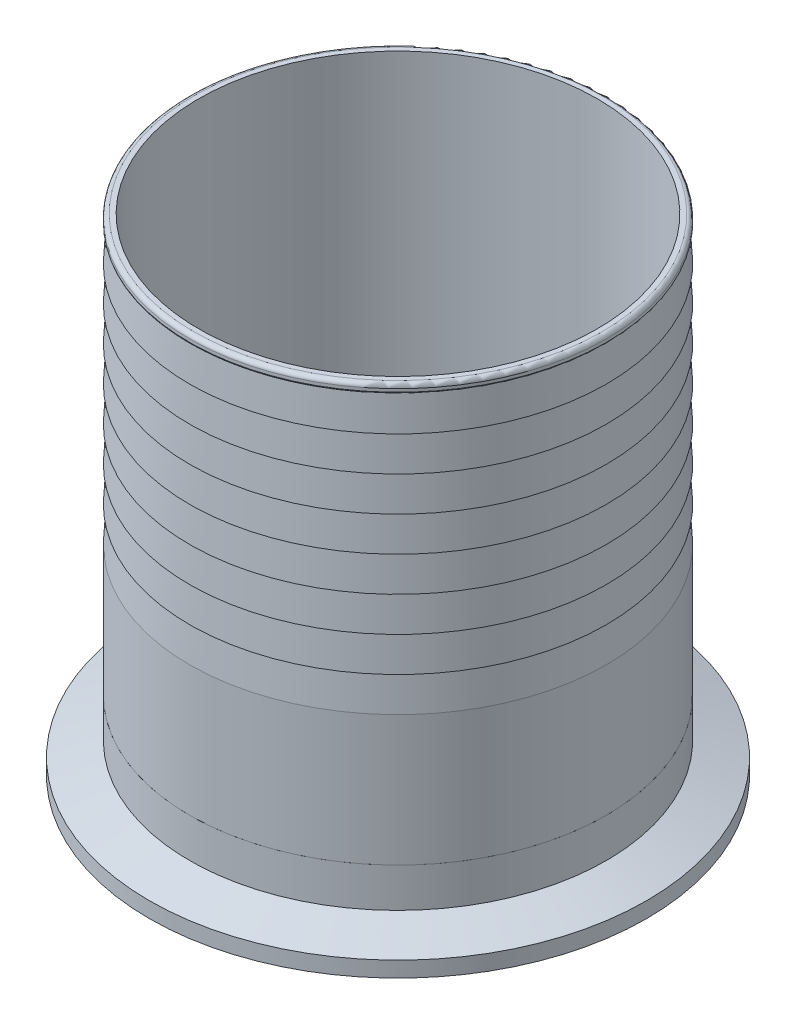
ISO-10303-21;
HEADER;
FILE_DESCRIPTION(('STEP AP214'),'2;1');
FILE_NAME('part.step','',(''),(''),'','','');
FILE_SCHEMA(('AUTOMOTIVE_DESIGN { 1 0 10303 214 1 1 1 1 }'));
ENDSEC;
DATA;
#1=APPLICATION_CONTEXT('core data for automotive mechanical design processes');
#2=APPLICATION_PROTOCOL_DEFINITION('international standard','automotive_design',2000,#1);
#3=PRODUCT_CONTEXT('',#1,'mechanical');
#4=PRODUCT('Part','Part','',(#3));
#5=PRODUCT_RELATED_PRODUCT_CATEGORY('part','',(#4));
#6=PRODUCT_DEFINITION_FORMATION('','',#4);
#7=PRODUCT_DEFINITION_CONTEXT('part definition',#1,'design');
#8=PRODUCT_DEFINITION('design','',#6,#7);
#9=PRODUCT_DEFINITION_SHAPE('','',#8);
#10=(LENGTH_UNIT() NAMED_UNIT(*) SI_UNIT(.MILLI.,.METRE.));
#11=(NAMED_UNIT(*) PLANE_ANGLE_UNIT() SI_UNIT($,.RADIAN.));
#12=(NAMED_UNIT(*) SI_UNIT($,.STERADIAN.) SOLID_ANGLE_UNIT());
#13=UNCERTAINTY_MEASURE_WITH_UNIT(LENGTH_MEASURE(1.E-05),#10,'distance_accuracy_value','');
#14=(GEOMETRIC_REPRESENTATION_CONTEXT(3) GLOBAL_UNCERTAINTY_ASSIGNED_CONTEXT((#13)) GLOBAL_UNIT_ASSIGNED_CONTEXT((#10,
#11,#12)) REPRESENTATION_CONTEXT('',''));
#15=CARTESIAN_POINT('',(0.,0.,0.));
#16=DIRECTION('',(0.,0.,1.));
#17=DIRECTION('',(1.,0.,0.));
#18=AXIS2_PLACEMENT_3D('',#15,#16,#17);
#19=CARTESIAN_POINT('',(54.015654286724,55.4729716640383,104.136902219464));
#20=DIRECTION('',(0.,-0.999999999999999,0.));
#21=DIRECTION('',(0.744309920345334,0.,-0.667834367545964));
#22=AXIS2_PLACEMENT_3D('',#19,#20,#21);
#23=PLANE('',#22);
#24=CARTESIAN_POINT('',(28.5711648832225,55.4729716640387,75.7786942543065));
#25=DIRECTION('',(0.,-0.999999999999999,0.));
#26=DIRECTION('',(0.744309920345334,0.,-0.667834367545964));
#27=AXIS2_PLACEMENT_3D('',#24,#25,#26);
#28=CIRCLE('',#27,36.449);
#29=CARTESIAN_POINT('',(55.7005171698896,55.4729716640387,51.4367993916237));
#30=VERTEX_POINT('',#29);
#31=EDGE_CURVE('P0_E85',#30,#30,#28,.T.);
#32=ORIENTED_EDGE('',*,*,#31,.F.);
#33=EDGE_LOOP('',(#32));
#34=FACE_BOUND('',#33,.T.);
#35=CARTESIAN_POINT('',(28.5711648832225,55.4729716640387,75.7786942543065));
#36=DIRECTION('',(0.,-0.999999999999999,0.));
#37=DIRECTION('',(0.744309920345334,0.,-0.667834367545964));
#38=AXIS2_PLACEMENT_3D('',#35,#36,#37);
#39=CIRCLE('',#38,38.1);
#40=CARTESIAN_POINT('',(56.9293728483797,55.4729716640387,50.3342048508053));
#41=VERTEX_POINT('',#40);
#42=EDGE_CURVE('P0_E9',#41,#41,#39,.T.);
#43=ORIENTED_EDGE('',*,*,#42,.T.);
#44=EDGE_LOOP('',(#43));
#45=FACE_BOUND('',#44,.T.);
#46=ADVANCED_FACE('P0_F14',(#34,#45),#23,.T.);
#47=CARTESIAN_POINT('',(28.5711648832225,55.4729716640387,75.7786942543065));
#48=DIRECTION('',(0.,-0.999999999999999,0.));
#49=DIRECTION('',(0.744309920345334,0.,-0.667834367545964));
#50=AXIS2_PLACEMENT_3D('',#47,#48,#49);
#51=CYLINDRICAL_SURFACE('',#50,38.1);
#52=CARTESIAN_POINT('',(28.5711648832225,79.2981716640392,75.7786942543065));
#53=DIRECTION('',(0.,-0.999999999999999,0.));
#54=DIRECTION('',(0.744309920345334,0.,-0.667834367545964));
#55=AXIS2_PLACEMENT_3D('',#52,#53,#54);
#56=CIRCLE('',#55,38.1);
#57=CARTESIAN_POINT('',(56.9293728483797,79.2981716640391,50.3342048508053));
#58=VERTEX_POINT('',#57);
#59=EDGE_CURVE('P0_E20',#58,#58,#56,.T.);
#60=CARTESIAN_POINT('',(56.9293728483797,79.2981716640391,50.3342048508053));
#61=CARTESIAN_POINT('',(56.9293728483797,79.0499924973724,50.3342048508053));
#62=CARTESIAN_POINT('',(56.9293728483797,78.8018133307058,50.3342048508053));
#63=CARTESIAN_POINT('',(56.9293728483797,78.3054549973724,50.3342048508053));
#64=CARTESIAN_POINT('',(56.9293728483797,78.0572758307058,50.3342048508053));
#65=CARTESIAN_POINT('',(56.9293728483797,77.5609174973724,50.3342048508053));
#66=CARTESIAN_POINT('',(56.9293728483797,77.3127383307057,50.3342048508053));
#67=CARTESIAN_POINT('',(56.9293728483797,76.8163799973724,50.3342048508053));
#68=CARTESIAN_POINT('',(56.9293728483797,76.5682008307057,50.3342048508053));
#69=CARTESIAN_POINT('',(56.9293728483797,76.0718424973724,50.3342048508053));
#70=CARTESIAN_POINT('',(56.9293728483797,75.8236633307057,50.3342048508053));
#71=CARTESIAN_POINT('',(56.9293728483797,75.3273049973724,50.3342048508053));
#72=CARTESIAN_POINT('',(56.9293728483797,75.0791258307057,50.3342048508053));
#73=CARTESIAN_POINT('',(56.9293728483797,74.5827674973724,50.3342048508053));
#74=CARTESIAN_POINT('',(56.9293728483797,74.3345883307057,50.3342048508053));
#75=CARTESIAN_POINT('',(56.9293728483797,73.8382299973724,50.3342048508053));
#76=CARTESIAN_POINT('',(56.9293728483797,73.5900508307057,50.3342048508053));
#77=CARTESIAN_POINT('',(56.9293728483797,73.0936924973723,50.3342048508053));
#78=CARTESIAN_POINT('',(56.9293728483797,72.8455133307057,50.3342048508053));
#79=CARTESIAN_POINT('',(56.9293728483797,72.3491549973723,50.3342048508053));
#80=CARTESIAN_POINT('',(56.9293728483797,72.1009758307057,50.3342048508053));
#81=CARTESIAN_POINT('',(56.9293728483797,71.6046174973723,50.3342048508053));
#82=CARTESIAN_POINT('',(56.9293728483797,71.3564383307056,50.3342048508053));
#83=CARTESIAN_POINT('',(56.9293728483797,70.8600799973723,50.3342048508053));
#84=CARTESIAN_POINT('',(56.9293728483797,70.6119008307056,50.3342048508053));
#85=CARTESIAN_POINT('',(56.9293728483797,70.1155424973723,50.3342048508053));
#86=CARTESIAN_POINT('',(56.9293728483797,69.8673633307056,50.3342048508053));
#87=CARTESIAN_POINT('',(56.9293728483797,69.3710049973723,50.3342048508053));
#88=CARTESIAN_POINT('',(56.9293728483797,69.1228258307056,50.3342048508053));
#89=CARTESIAN_POINT('',(56.9293728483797,68.6264674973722,50.3342048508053));
#90=CARTESIAN_POINT('',(56.9293728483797,68.3782883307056,50.3342048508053));
#91=CARTESIAN_POINT('',(56.9293728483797,67.8819299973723,50.3342048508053));
#92=CARTESIAN_POINT('',(56.9293728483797,67.6337508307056,50.3342048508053));
#93=CARTESIAN_POINT('',(56.9293728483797,67.1373924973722,50.3342048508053));
#94=CARTESIAN_POINT('',(56.9293728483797,66.8892133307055,50.3342048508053));
#95=CARTESIAN_POINT('',(56.9293728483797,66.3928549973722,50.3342048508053));
#96=CARTESIAN_POINT('',(56.9293728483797,66.1446758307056,50.3342048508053));
#97=CARTESIAN_POINT('',(56.9293728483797,65.6483174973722,50.3342048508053));
#98=CARTESIAN_POINT('',(56.9293728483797,65.4001383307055,50.3342048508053));
#99=CARTESIAN_POINT('',(56.9293728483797,64.9037799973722,50.3342048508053));
#100=CARTESIAN_POINT('',(56.9293728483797,64.6556008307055,50.3342048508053));
#101=CARTESIAN_POINT('',(56.9293728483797,64.1592424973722,50.3342048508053));
#102=CARTESIAN_POINT('',(56.9293728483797,63.9110633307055,50.3342048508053));
#103=CARTESIAN_POINT('',(56.9293728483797,63.4147049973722,50.3342048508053));
#104=CARTESIAN_POINT('',(56.9293728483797,63.1665258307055,50.3342048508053));
#105=CARTESIAN_POINT('',(56.9293728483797,62.6701674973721,50.3342048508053));
#106=CARTESIAN_POINT('',(56.9293728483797,62.4219883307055,50.3342048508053));
#107=CARTESIAN_POINT('',(56.9293728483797,61.9256299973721,50.3342048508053));
#108=CARTESIAN_POINT('',(56.9293728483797,61.6774508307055,50.3342048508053));
#109=CARTESIAN_POINT('',(56.9293728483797,61.1810924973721,50.3342048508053));
#110=CARTESIAN_POINT('',(56.9293728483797,60.9329133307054,50.3342048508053));
#111=CARTESIAN_POINT('',(56.9293728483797,60.4365549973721,50.3342048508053));
#112=CARTESIAN_POINT('',(56.9293728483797,60.1883758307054,50.3342048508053));
#113=CARTESIAN_POINT('',(56.9293728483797,59.6920174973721,50.3342048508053));
#114=CARTESIAN_POINT('',(56.9293728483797,59.4438383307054,50.3342048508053));
#115=CARTESIAN_POINT('',(56.9293728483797,58.9474799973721,50.3342048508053));
#116=CARTESIAN_POINT('',(56.9293728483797,58.6993008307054,50.3342048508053));
#117=CARTESIAN_POINT('',(56.9293728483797,58.2029424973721,50.3342048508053));
#118=CARTESIAN_POINT('',(56.9293728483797,57.9547633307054,50.3342048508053));
#119=CARTESIAN_POINT('',(56.9293728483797,57.458404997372,50.3342048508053));
#120=CARTESIAN_POINT('',(56.9293728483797,57.2102258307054,50.3342048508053));
#121=CARTESIAN_POINT('',(56.9293728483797,56.713867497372,50.3342048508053));
#122=CARTESIAN_POINT('',(56.9293728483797,56.4656883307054,50.3342048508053));
#123=CARTESIAN_POINT('',(56.9293728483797,55.969329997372,50.3342048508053));
#124=CARTESIAN_POINT('',(56.9293728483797,55.7211508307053,50.3342048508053));
#125=CARTESIAN_POINT('',(56.9293728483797,55.4729716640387,50.3342048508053));
#126=B_SPLINE_CURVE_WITH_KNOTS('',3,(#60,#61,#62,#63,#64,#65,#66,#67,#68,#69,#70,#71,#72,#73,
#74,#75,#76,#77,#78,#79,#80,#81,#82,#83,#84,#85,#86,#87,#88,#89,#90,#91,#92,#93,#94,#95,#96,#97,
#98,#99,#100,#101,#102,#103,#104,#105,#106,#107,#108,#109,#110,#111,#112,#113,#114,#115,#116,
#117,#118,#119,#120,#121,#122,#123,#124,#125),.UNSPECIFIED.,.F.,.F.,(4,2,2,2,2,2,2,2,2,2,2,2,2,
2,2,2,2,2,2,2,2,2,2,2,2,2,2,2,2,2,2,2,4),(0.,0.744537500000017,1.48907500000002,
2.23361250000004,2.97815000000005,3.72268750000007,4.46722500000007,5.21176250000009,
5.95630000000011,6.70083750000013,7.44537500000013,8.18991250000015,8.93445000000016,
9.67898750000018,10.4235250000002,11.1680625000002,11.9126000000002,12.6571375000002,
13.4016750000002,14.1462125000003,14.8907500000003,15.6352875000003,16.3798250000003,
17.1243625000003,17.8689000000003,18.6134375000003,19.3579750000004,20.1025125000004,
20.8470500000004,21.5915875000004,22.3361250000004,23.0806625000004,23.8252000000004),.UNSPECIFIED.);
#127=EDGE_CURVE('P0_BSEAM101',#58,#41,#126,.T.);
#128=ORIENTED_EDGE('',*,*,#59,.T.);
#129=ORIENTED_EDGE('',*,*,#42,.F.);
#130=ORIENTED_EDGE('',*,*,#127,.T.);
#131=ORIENTED_EDGE('',*,*,#127,.F.);
#132=EDGE_LOOP('',(#128,#130,#129,#131));
#133=FACE_BOUND('',#132,.T.);
#134=ADVANCED_FACE('P0_F101',(#133),#51,.T.);
#135=CARTESIAN_POINT('',(28.5711648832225,79.2981716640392,75.7786942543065));
#136=DIRECTION('',(0.,-0.999999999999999,0.));
#137=DIRECTION('',(0.744309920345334,0.,-0.667834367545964));
#138=AXIS2_PLACEMENT_3D('',#135,#136,#137);
#139=CONICAL_SURFACE('',#138,38.1,0.0599281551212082);
#140=CARTESIAN_POINT('',(28.5711648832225,85.6481716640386,75.7786942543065));
#141=DIRECTION('',(0.,-0.999999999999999,0.));
#142=DIRECTION('',(0.744309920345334,0.,-0.667834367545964));
#143=AXIS2_PLACEMENT_3D('',#140,#141,#142);
#144=CIRCLE('',#143,37.719);
#145=CARTESIAN_POINT('',(56.6457907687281,85.6481716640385,50.5886497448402));
#146=VERTEX_POINT('',#145);
#147=EDGE_CURVE('P0_E24',#146,#146,#144,.T.);
#148=CARTESIAN_POINT('',(56.6457907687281,85.6481716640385,50.5886497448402));
#149=CARTESIAN_POINT('',(56.6487447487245,85.5820258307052,50.585999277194));
#150=CARTESIAN_POINT('',(56.6516987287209,85.5158799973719,50.5833488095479));
#151=CARTESIAN_POINT('',(56.6576066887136,85.3835883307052,50.5780478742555));
#152=CARTESIAN_POINT('',(56.66056066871,85.3174424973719,50.5753974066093));
#153=CARTESIAN_POINT('',(56.6664686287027,85.1851508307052,50.5700964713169));
#154=CARTESIAN_POINT('',(56.6694226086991,85.1190049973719,50.5674460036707));
#155=CARTESIAN_POINT('',(56.6753305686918,84.9867133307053,50.5621450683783));
#156=CARTESIAN_POINT('',(56.6782845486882,84.9205674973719,50.5594946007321));
#157=CARTESIAN_POINT('',(56.684192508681,84.7882758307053,50.5541936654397));
#158=CARTESIAN_POINT('',(56.6871464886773,84.7221299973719,50.5515431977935));
#159=CARTESIAN_POINT('',(56.6930544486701,84.5898383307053,50.5462422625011));
#160=CARTESIAN_POINT('',(56.6960084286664,84.523692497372,50.5435917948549));
#161=CARTESIAN_POINT('',(56.7019163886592,84.3914008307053,50.5382908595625));
#162=CARTESIAN_POINT('',(56.7048703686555,84.325254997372,50.5356403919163));
#163=CARTESIAN_POINT('',(56.7107783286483,84.1929633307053,50.5303394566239));
#164=CARTESIAN_POINT('',(56.7137323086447,84.126817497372,50.5276889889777));
#165=CARTESIAN_POINT('',(56.7196402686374,83.9945258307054,50.5223880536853));
#166=CARTESIAN_POINT('',(56.7225942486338,83.928379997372,50.5197375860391));
#167=CARTESIAN_POINT('',(56.7285022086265,83.7960883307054,50.5144366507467));
#168=CARTESIAN_POINT('',(56.7314561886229,83.729942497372,50.5117861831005));
#169=CARTESIAN_POINT('',(56.7373641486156,83.5976508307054,50.5064852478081));
#170=CARTESIAN_POINT('',(56.740318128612,83.5315049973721,50.5038347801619));
#171=CARTESIAN_POINT('',(56.7462260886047,83.3992133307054,50.4985338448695));
#172=CARTESIAN_POINT('',(56.7491800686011,83.3330674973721,50.4958833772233));
#173=CARTESIAN_POINT('',(56.7550880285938,83.2007758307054,50.4905824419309));
#174=CARTESIAN_POINT('',(56.7580420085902,83.1346299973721,50.4879319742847));
#175=CARTESIAN_POINT('',(56.7639499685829,83.0023383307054,50.4826310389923));
#176=CARTESIAN_POINT('',(56.7669039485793,82.9361924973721,50.4799805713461));
#177=CARTESIAN_POINT('',(56.7728119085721,82.8039008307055,50.4746796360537));
#178=CARTESIAN_POINT('',(56.7757658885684,82.7377549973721,50.4720291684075));
#179=CARTESIAN_POINT('',(56.7816738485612,82.6054633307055,50.4667282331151));
#180=CARTESIAN_POINT('',(56.7846278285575,82.5393174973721,50.464077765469));
#181=CARTESIAN_POINT('',(56.7905357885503,82.4070258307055,50.4587768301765));
#182=CARTESIAN_POINT('',(56.7934897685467,82.3408799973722,50.4561263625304));
#183=CARTESIAN_POINT('',(56.7993977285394,82.2085883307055,50.450825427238));
#184=CARTESIAN_POINT('',(56.8023517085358,82.1424424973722,50.4481749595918));
#185=CARTESIAN_POINT('',(56.8082596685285,82.0101508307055,50.4428740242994));
#186=CARTESIAN_POINT('',(56.8112136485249,81.9440049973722,50.4402235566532));
#187=CARTESIAN_POINT('',(56.8171216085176,81.8117133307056,50.4349226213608));
#188=CARTESIAN_POINT('',(56.820075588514,81.7455674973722,50.4322721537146));
#189=CARTESIAN_POINT('',(56.8259835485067,81.6132758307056,50.4269712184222));
#190=CARTESIAN_POINT('',(56.8289375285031,81.5471299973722,50.424320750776));
#191=CARTESIAN_POINT('',(56.8348454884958,81.4148383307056,50.4190198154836));
#192=CARTESIAN_POINT('',(56.8377994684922,81.3486924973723,50.4163693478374));
#193=CARTESIAN_POINT('',(56.8437074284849,81.2164008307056,50.411068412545));
#194=CARTESIAN_POINT('',(56.8466614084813,81.1502549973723,50.4084179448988));
#195=CARTESIAN_POINT('',(56.8525693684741,81.0179633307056,50.4031170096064));
#196=CARTESIAN_POINT('',(56.8555233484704,80.9518174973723,50.4004665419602));
#197=CARTESIAN_POINT('',(56.8614313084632,80.8195258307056,50.3951656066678));
#198=CARTESIAN_POINT('',(56.8643852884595,80.7533799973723,50.3925151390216));
#199=CARTESIAN_POINT('',(56.8702932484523,80.6210883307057,50.3872142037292));
#200=CARTESIAN_POINT('',(56.8732472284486,80.5549424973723,50.384563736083));
#201=CARTESIAN_POINT('',(56.8791551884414,80.4226508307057,50.3792628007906));
#202=CARTESIAN_POINT('',(56.8821091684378,80.3565049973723,50.3766123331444));
#203=CARTESIAN_POINT('',(56.8880171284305,80.2242133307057,50.371311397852));
#204=CARTESIAN_POINT('',(56.8909711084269,80.1580674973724,50.3686609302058));
#205=CARTESIAN_POINT('',(56.8968790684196,80.0257758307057,50.3633599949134));
#206=CARTESIAN_POINT('',(56.899833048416,79.9596299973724,50.3607095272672));
#207=CARTESIAN_POINT('',(56.9057410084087,79.8273383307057,50.3554085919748));
#208=CARTESIAN_POINT('',(56.9086949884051,79.7611924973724,50.3527581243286));
#209=CARTESIAN_POINT('',(56.9146029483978,79.6289008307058,50.3474571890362));
#210=CARTESIAN_POINT('',(56.9175569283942,79.5627549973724,50.34480672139));
#211=CARTESIAN_POINT('',(56.9234648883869,79.4304633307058,50.3395057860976));
#212=CARTESIAN_POINT('',(56.9264188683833,79.3643174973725,50.3368553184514));
#213=CARTESIAN_POINT('',(56.9293728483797,79.2981716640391,50.3342048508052));
#214=B_SPLINE_CURVE_WITH_KNOTS('',3,(#148,#149,#150,#151,#152,#153,#154,#155,#156,#157,#158,
#159,#160,#161,#162,#163,#164,#165,#166,#167,#168,#169,#170,#171,#172,#173,#174,#175,#176,#177,
#178,#179,#180,#181,#182,#183,#184,#185,#186,#187,#188,#189,#190,#191,#192,#193,#194,#195,#196,
#197,#198,#199,#200,#201,#202,#203,#204,#205,#206,#207,#208,#209,#210,#211,#212,#213),
.UNSPECIFIED.,.F.,.F.,(4,2,2,2,2,2,2,2,2,2,2,2,2,2,2,2,2,2,2,2,2,2,2,2,2,2,2,2,2,2,2,2,4),(0.,
0.198794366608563,0.397588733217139,0.596383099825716,0.795177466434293,0.993971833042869,
1.19276619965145,1.39156056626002,1.5903549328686,1.78914929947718,1.98794366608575,
2.18673803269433,2.38553239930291,2.58432676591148,2.78312113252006,2.98191549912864,
3.18070986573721,3.37950423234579,3.57829859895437,3.77709296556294,3.97588733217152,
4.1746816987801,4.37347606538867,4.57227043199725,4.77106479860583,4.9698591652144,
5.16865353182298,5.36744789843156,5.56624226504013,5.76503663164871,5.96383099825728,
6.16262536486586,6.36141973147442),.UNSPECIFIED.);
#215=EDGE_CURVE('P0_BSEAM106',#146,#58,#214,.T.);
#216=ORIENTED_EDGE('',*,*,#147,.T.);
#217=ORIENTED_EDGE('',*,*,#59,.F.);
#218=ORIENTED_EDGE('',*,*,#215,.T.);
#219=ORIENTED_EDGE('',*,*,#215,.F.);
#220=EDGE_LOOP('',(#216,#218,#217,#219));
#221=FACE_BOUND('',#220,.T.);
#222=ADVANCED_FACE('P0_F106',(#221),#139,.T.);
#223=CARTESIAN_POINT('',(54.0156542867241,85.6481716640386,104.136902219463));
#224=DIRECTION('',(0.,-0.999999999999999,0.));
#225=DIRECTION('',(0.744309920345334,0.,-0.667834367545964));
#226=AXIS2_PLACEMENT_3D('',#223,#224,#225);
#227=PLANE('',#226);
#228=CARTESIAN_POINT('',(28.5711648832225,85.6481716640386,75.7786942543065));
#229=DIRECTION('',(0.,-0.999999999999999,0.));
#230=DIRECTION('',(0.744309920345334,0.,-0.667834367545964));
#231=AXIS2_PLACEMENT_3D('',#228,#229,#230);
#232=CIRCLE('',#231,38.1);
#233=CARTESIAN_POINT('',(56.9293728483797,85.6481716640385,50.3342048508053));
#234=VERTEX_POINT('',#233);
#235=EDGE_CURVE('P0_E28',#234,#234,#232,.T.);
#236=ORIENTED_EDGE('',*,*,#235,.T.);
#237=EDGE_LOOP('',(#236));
#238=FACE_BOUND('',#237,.T.);
#239=ORIENTED_EDGE('',*,*,#147,.F.);
#240=EDGE_LOOP('',(#239));
#241=FACE_BOUND('',#240,.T.);
#242=ADVANCED_FACE('P0_F110',(#238,#241),#227,.T.);
#243=CARTESIAN_POINT('',(28.5711648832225,85.6481716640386,75.7786942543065));
#244=DIRECTION('',(0.,-0.999999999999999,0.));
#245=DIRECTION('',(0.744309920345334,0.,-0.667834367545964));
#246=AXIS2_PLACEMENT_3D('',#243,#244,#245);
#247=CONICAL_SURFACE('',#246,38.1,0.0599281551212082);
#248=CARTESIAN_POINT('',(28.5711648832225,91.9981716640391,75.7786942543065));
#249=DIRECTION('',(0.,-0.999999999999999,0.));
#250=DIRECTION('',(0.744309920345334,0.,-0.667834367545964));
#251=AXIS2_PLACEMENT_3D('',#248,#249,#250);
#252=CIRCLE('',#251,37.719);
#253=CARTESIAN_POINT('',(56.6457907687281,91.998171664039,50.5886497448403));
#254=VERTEX_POINT('',#253);
#255=EDGE_CURVE('P0_E33',#254,#254,#252,.T.);
#256=CARTESIAN_POINT('',(56.6457907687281,91.998171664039,50.5886497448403));
#257=CARTESIAN_POINT('',(56.6487447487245,91.9320258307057,50.5859992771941));
#258=CARTESIAN_POINT('',(56.6516987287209,91.8658799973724,50.5833488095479));
#259=CARTESIAN_POINT('',(56.6576066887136,91.7335883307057,50.5780478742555));
#260=CARTESIAN_POINT('',(56.66056066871,91.6674424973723,50.5753974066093));
#261=CARTESIAN_POINT('',(56.6664686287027,91.5351508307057,50.5700964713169));
#262=CARTESIAN_POINT('',(56.6694226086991,91.4690049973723,50.5674460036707));
#263=CARTESIAN_POINT('',(56.6753305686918,91.3367133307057,50.5621450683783));
#264=CARTESIAN_POINT('',(56.6782845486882,91.2705674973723,50.5594946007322));
#265=CARTESIAN_POINT('',(56.684192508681,91.1382758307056,50.5541936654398));
#266=CARTESIAN_POINT('',(56.6871464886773,91.0721299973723,50.5515431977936));
#267=CARTESIAN_POINT('',(56.6930544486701,90.9398383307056,50.5462422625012));
#268=CARTESIAN_POINT('',(56.6960084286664,90.8736924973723,50.543591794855));
#269=CARTESIAN_POINT('',(56.7019163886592,90.7414008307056,50.5382908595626));
#270=CARTESIAN_POINT('',(56.7048703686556,90.6752549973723,50.5356403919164));
#271=CARTESIAN_POINT('',(56.7107783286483,90.5429633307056,50.530339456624));
#272=CARTESIAN_POINT('',(56.7137323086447,90.4768174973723,50.5276889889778));
#273=CARTESIAN_POINT('',(56.7196402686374,90.3445258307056,50.5223880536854));
#274=CARTESIAN_POINT('',(56.7225942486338,90.2783799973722,50.5197375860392));
#275=CARTESIAN_POINT('',(56.7285022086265,90.1460883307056,50.5144366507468));
#276=CARTESIAN_POINT('',(56.7314561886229,90.0799424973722,50.5117861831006));
#277=CARTESIAN_POINT('',(56.7373641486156,89.9476508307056,50.5064852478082));
#278=CARTESIAN_POINT('',(56.740318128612,89.8815049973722,50.503834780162));
#279=CARTESIAN_POINT('',(56.7462260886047,89.7492133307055,50.4985338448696));
#280=CARTESIAN_POINT('',(56.7491800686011,89.6830674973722,50.4958833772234));
#281=CARTESIAN_POINT('',(56.7550880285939,89.5507758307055,50.490582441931));
#282=CARTESIAN_POINT('',(56.7580420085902,89.4846299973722,50.4879319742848));
#283=CARTESIAN_POINT('',(56.763949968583,89.3523383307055,50.4826310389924));
#284=CARTESIAN_POINT('',(56.7669039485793,89.2861924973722,50.4799805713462));
#285=CARTESIAN_POINT('',(56.7728119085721,89.1539008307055,50.4746796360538));
#286=CARTESIAN_POINT('',(56.7757658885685,89.0877549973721,50.4720291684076));
#287=CARTESIAN_POINT('',(56.7816738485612,88.9554633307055,50.4667282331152));
#288=CARTESIAN_POINT('',(56.7846278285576,88.8893174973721,50.464077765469));
#289=CARTESIAN_POINT('',(56.7905357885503,88.7570258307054,50.4587768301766));
#290=CARTESIAN_POINT('',(56.7934897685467,88.6908799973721,50.4561263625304));
#291=CARTESIAN_POINT('',(56.7993977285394,88.5585883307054,50.450825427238));
#292=CARTESIAN_POINT('',(56.8023517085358,88.4924424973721,50.4481749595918));
#293=CARTESIAN_POINT('',(56.8082596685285,88.3601508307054,50.4428740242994));
#294=CARTESIAN_POINT('',(56.8112136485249,88.2940049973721,50.4402235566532));
#295=CARTESIAN_POINT('',(56.8171216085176,88.1617133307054,50.4349226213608));
#296=CARTESIAN_POINT('',(56.820075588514,88.0955674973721,50.4322721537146));
#297=CARTESIAN_POINT('',(56.8259835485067,87.9632758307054,50.4269712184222));
#298=CARTESIAN_POINT('',(56.8289375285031,87.897129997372,50.424320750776));
#299=CARTESIAN_POINT('',(56.8348454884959,87.7648383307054,50.4190198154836));
#300=CARTESIAN_POINT('',(56.8377994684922,87.698692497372,50.4163693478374));
#301=CARTESIAN_POINT('',(56.843707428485,87.5664008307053,50.411068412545));
#302=CARTESIAN_POINT('',(56.8466614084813,87.500254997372,50.4084179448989));
#303=CARTESIAN_POINT('',(56.8525693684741,87.3679633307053,50.4031170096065));
#304=CARTESIAN_POINT('',(56.8555233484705,87.301817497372,50.4004665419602));
#305=CARTESIAN_POINT('',(56.8614313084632,87.1695258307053,50.3951656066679));
#306=CARTESIAN_POINT('',(56.8643852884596,87.103379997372,50.3925151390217));
#307=CARTESIAN_POINT('',(56.8702932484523,86.9710883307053,50.3872142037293));
#308=CARTESIAN_POINT('',(56.8732472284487,86.904942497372,50.3845637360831));
#309=CARTESIAN_POINT('',(56.8791551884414,86.7726508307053,50.3792628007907));
#310=CARTESIAN_POINT('',(56.8821091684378,86.7065049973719,50.3766123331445));
#311=CARTESIAN_POINT('',(56.8880171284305,86.5742133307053,50.3713113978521));
#312=CARTESIAN_POINT('',(56.8909711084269,86.5080674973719,50.3686609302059));
#313=CARTESIAN_POINT('',(56.8968790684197,86.3757758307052,50.3633599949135));
#314=CARTESIAN_POINT('',(56.899833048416,86.3096299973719,50.3607095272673));
#315=CARTESIAN_POINT('',(56.9057410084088,86.1773383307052,50.3554085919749));
#316=CARTESIAN_POINT('',(56.9086949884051,86.1111924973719,50.3527581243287));
#317=CARTESIAN_POINT('',(56.9146029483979,85.9789008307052,50.3474571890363));
#318=CARTESIAN_POINT('',(56.9175569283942,85.9127549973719,50.3448067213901));
#319=CARTESIAN_POINT('',(56.923464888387,85.7804633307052,50.3395057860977));
#320=CARTESIAN_POINT('',(56.9264188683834,85.7143174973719,50.3368553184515));
#321=CARTESIAN_POINT('',(56.9293728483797,85.6481716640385,50.3342048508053));
#322=B_SPLINE_CURVE_WITH_KNOTS('',3,(#256,#257,#258,#259,#260,#261,#262,#263,#264,#265,#266,
#267,#268,#269,#270,#271,#272,#273,#274,#275,#276,#277,#278,#279,#280,#281,#282,#283,#284,#285,
#286,#287,#288,#289,#290,#291,#292,#293,#294,#295,#296,#297,#298,#299,#300,#301,#302,#303,#304,
#305,#306,#307,#308,#309,#310,#311,#312,#313,#314,#315,#316,#317,#318,#319,#320,#321),
.UNSPECIFIED.,.F.,.F.,(4,2,2,2,2,2,2,2,2,2,2,2,2,2,2,2,2,2,2,2,2,2,2,2,2,2,2,2,2,2,2,2,4),(0.,
0.198794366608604,0.397588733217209,0.596383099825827,0.795177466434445,0.99397183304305,
1.19276619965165,1.39156056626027,1.59035493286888,1.7891492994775,1.9879436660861,
2.18673803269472,2.38553239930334,2.58432676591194,2.78312113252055,2.98191549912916,
3.18070986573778,3.37950423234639,3.57829859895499,3.77709296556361,3.97588733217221,
4.17468169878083,4.37347606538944,4.57227043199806,4.77106479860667,4.96985916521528,
5.16865353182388,5.3674478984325,5.56624226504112,5.76503663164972,5.96383099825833,
6.16262536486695,6.36141973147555),.UNSPECIFIED.);
#323=EDGE_CURVE('P0_BSEAM117',#254,#234,#322,.T.);
#324=ORIENTED_EDGE('',*,*,#255,.T.);
#325=ORIENTED_EDGE('',*,*,#235,.F.);
#326=ORIENTED_EDGE('',*,*,#323,.T.);
#327=ORIENTED_EDGE('',*,*,#323,.F.);
#328=EDGE_LOOP('',(#324,#326,#325,#327));
#329=FACE_BOUND('',#328,.T.);
#330=ADVANCED_FACE('P0_F117',(#329),#247,.T.);
#331=CARTESIAN_POINT('',(54.0156542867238,91.998171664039,104.136902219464));
#332=DIRECTION('',(0.,-0.999999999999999,0.));
#333=DIRECTION('',(0.744309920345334,0.,-0.667834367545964));
#334=AXIS2_PLACEMENT_3D('',#331,#332,#333);
#335=PLANE('',#334);
#336=CARTESIAN_POINT('',(28.5711648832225,91.998171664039,75.7786942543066));
#337=DIRECTION('',(0.,-0.999999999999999,0.));
#338=DIRECTION('',(0.744309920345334,0.,-0.667834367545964));
#339=AXIS2_PLACEMENT_3D('',#336,#337,#338);
#340=CIRCLE('',#339,38.1);
#341=CARTESIAN_POINT('',(56.9293728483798,91.9981716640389,50.3342048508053));
#342=VERTEX_POINT('',#341);
#343=EDGE_CURVE('P0_E36',#342,#342,#340,.T.);
#344=ORIENTED_EDGE('',*,*,#343,.T.);
#345=EDGE_LOOP('',(#344));
#346=FACE_BOUND('',#345,.T.);
#347=ORIENTED_EDGE('',*,*,#255,.F.);
#348=EDGE_LOOP('',(#347));
#349=FACE_BOUND('',#348,.T.);
#350=ADVANCED_FACE('P0_F121',(#346,#349),#335,.T.);
#351=CARTESIAN_POINT('',(28.5711648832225,91.998171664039,75.7786942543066));
#352=DIRECTION('',(0.,-0.999999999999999,0.));
#353=DIRECTION('',(0.744309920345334,0.,-0.667834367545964));
#354=AXIS2_PLACEMENT_3D('',#351,#352,#353);
#355=CONICAL_SURFACE('',#354,38.1,0.0599281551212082);
#356=CARTESIAN_POINT('',(28.5711648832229,98.3481716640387,75.7786942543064));
#357=DIRECTION('',(0.,-0.999999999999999,0.));
#358=DIRECTION('',(0.744309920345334,0.,-0.667834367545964));
#359=AXIS2_PLACEMENT_3D('',#356,#357,#358);
#360=CIRCLE('',#359,37.719);
#361=CARTESIAN_POINT('',(56.6457907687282,98.3481716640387,50.5886497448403));
#362=VERTEX_POINT('',#361);
#363=EDGE_CURVE('P0_E39',#362,#362,#360,.T.);
#364=CARTESIAN_POINT('',(56.6457907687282,98.3481716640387,50.5886497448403));
#365=CARTESIAN_POINT('',(56.6487447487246,98.2820258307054,50.5859992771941));
#366=CARTESIAN_POINT('',(56.651698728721,98.215879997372,50.5833488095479));
#367=CARTESIAN_POINT('',(56.6576066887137,98.0835883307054,50.5780478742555));
#368=CARTESIAN_POINT('',(56.6605606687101,98.017442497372,50.5753974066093));
#369=CARTESIAN_POINT('',(56.6664686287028,97.8851508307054,50.5700964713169));
#370=CARTESIAN_POINT('',(56.6694226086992,97.819004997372,50.5674460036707));
#371=CARTESIAN_POINT('',(56.6753305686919,97.6867133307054,50.5621450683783));
#372=CARTESIAN_POINT('',(56.6782845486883,97.620567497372,50.5594946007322));
#373=CARTESIAN_POINT('',(56.684192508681,97.4882758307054,50.5541936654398));
#374=CARTESIAN_POINT('',(56.6871464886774,97.4221299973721,50.5515431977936));
#375=CARTESIAN_POINT('',(56.6930544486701,97.2898383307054,50.5462422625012));
#376=CARTESIAN_POINT('',(56.6960084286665,97.2236924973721,50.543591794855));
#377=CARTESIAN_POINT('',(56.7019163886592,97.0914008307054,50.5382908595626));
#378=CARTESIAN_POINT('',(56.7048703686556,97.0252549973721,50.5356403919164));
#379=CARTESIAN_POINT('',(56.7107783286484,96.8929633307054,50.530339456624));
#380=CARTESIAN_POINT('',(56.7137323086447,96.8268174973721,50.5276889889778));
#381=CARTESIAN_POINT('',(56.7196402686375,96.6945258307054,50.5223880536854));
#382=CARTESIAN_POINT('',(56.7225942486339,96.6283799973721,50.5197375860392));
#383=CARTESIAN_POINT('',(56.7285022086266,96.4960883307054,50.5144366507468));
#384=CARTESIAN_POINT('',(56.731456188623,96.4299424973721,50.5117861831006));
#385=CARTESIAN_POINT('',(56.7373641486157,96.2976508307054,50.5064852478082));
#386=CARTESIAN_POINT('',(56.7403181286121,96.2315049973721,50.503834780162));
#387=CARTESIAN_POINT('',(56.7462260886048,96.0992133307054,50.4985338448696));
#388=CARTESIAN_POINT('',(56.7491800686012,96.0330674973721,50.4958833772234));
#389=CARTESIAN_POINT('',(56.7550880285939,95.9007758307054,50.490582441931));
#390=CARTESIAN_POINT('',(56.7580420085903,95.8346299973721,50.4879319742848));
#391=CARTESIAN_POINT('',(56.763949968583,95.7023383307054,50.4826310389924));
#392=CARTESIAN_POINT('',(56.7669039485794,95.6361924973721,50.4799805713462));
#393=CARTESIAN_POINT('',(56.7728119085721,95.5039008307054,50.4746796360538));
#394=CARTESIAN_POINT('',(56.7757658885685,95.4377549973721,50.4720291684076));
#395=CARTESIAN_POINT('',(56.7816738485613,95.3054633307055,50.4667282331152));
#396=CARTESIAN_POINT('',(56.7846278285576,95.2393174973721,50.464077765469));
#397=CARTESIAN_POINT('',(56.7905357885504,95.1070258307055,50.4587768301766));
#398=CARTESIAN_POINT('',(56.7934897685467,95.0408799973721,50.4561263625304));
#399=CARTESIAN_POINT('',(56.7993977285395,94.9085883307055,50.450825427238));
#400=CARTESIAN_POINT('',(56.8023517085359,94.8424424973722,50.4481749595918));
#401=CARTESIAN_POINT('',(56.8082596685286,94.7101508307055,50.4428740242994));
#402=CARTESIAN_POINT('',(56.811213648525,94.6440049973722,50.4402235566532));
#403=CARTESIAN_POINT('',(56.8171216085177,94.5117133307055,50.4349226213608));
#404=CARTESIAN_POINT('',(56.8200755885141,94.4455674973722,50.4322721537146));
#405=CARTESIAN_POINT('',(56.8259835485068,94.3132758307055,50.4269712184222));
#406=CARTESIAN_POINT('',(56.8289375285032,94.2471299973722,50.4243207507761));
#407=CARTESIAN_POINT('',(56.8348454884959,94.1148383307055,50.4190198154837));
#408=CARTESIAN_POINT('',(56.8377994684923,94.0486924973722,50.4163693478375));
#409=CARTESIAN_POINT('',(56.843707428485,93.9164008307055,50.4110684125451));
#410=CARTESIAN_POINT('',(56.8466614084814,93.8502549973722,50.4084179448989));
#411=CARTESIAN_POINT('',(56.8525693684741,93.7179633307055,50.4031170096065));
#412=CARTESIAN_POINT('',(56.8555233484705,93.6518174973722,50.4004665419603));
#413=CARTESIAN_POINT('',(56.8614313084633,93.5195258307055,50.3951656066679));
#414=CARTESIAN_POINT('',(56.8643852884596,93.4533799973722,50.3925151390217));
#415=CARTESIAN_POINT('',(56.8702932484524,93.3210883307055,50.3872142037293));
#416=CARTESIAN_POINT('',(56.8732472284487,93.2549424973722,50.3845637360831));
#417=CARTESIAN_POINT('',(56.8791551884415,93.1226508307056,50.3792628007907));
#418=CARTESIAN_POINT('',(56.8821091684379,93.0565049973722,50.3766123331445));
#419=CARTESIAN_POINT('',(56.8880171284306,92.9242133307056,50.3713113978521));
#420=CARTESIAN_POINT('',(56.890971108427,92.8580674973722,50.3686609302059));
#421=CARTESIAN_POINT('',(56.8968790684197,92.7257758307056,50.3633599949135));
#422=CARTESIAN_POINT('',(56.8998330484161,92.6596299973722,50.3607095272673));
#423=CARTESIAN_POINT('',(56.9057410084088,92.5273383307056,50.3554085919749));
#424=CARTESIAN_POINT('',(56.9086949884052,92.4611924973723,50.3527581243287));
#425=CARTESIAN_POINT('',(56.9146029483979,92.3289008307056,50.3474571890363));
#426=CARTESIAN_POINT('',(56.9175569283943,92.2627549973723,50.3448067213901));
#427=CARTESIAN_POINT('',(56.923464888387,92.1304633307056,50.3395057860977));
#428=CARTESIAN_POINT('',(56.9264188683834,92.0643174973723,50.3368553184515));
#429=CARTESIAN_POINT('',(56.9293728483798,91.9981716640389,50.3342048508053));
#430=B_SPLINE_CURVE_WITH_KNOTS('',3,(#364,#365,#366,#367,#368,#369,#370,#371,#372,#373,#374,
#375,#376,#377,#378,#379,#380,#381,#382,#383,#384,#385,#386,#387,#388,#389,#390,#391,#392,#393,
#394,#395,#396,#397,#398,#399,#400,#401,#402,#403,#404,#405,#406,#407,#408,#409,#410,#411,#412,
#413,#414,#415,#416,#417,#418,#419,#420,#421,#422,#423,#424,#425,#426,#427,#428,#429),
.UNSPECIFIED.,.F.,.F.,(4,2,2,2,2,2,2,2,2,2,2,2,2,2,2,2,2,2,2,2,2,2,2,2,2,2,2,2,2,2,2,2,4),(0.,
0.198794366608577,0.397588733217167,0.596383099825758,0.795177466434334,0.993971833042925,
1.19276619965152,1.39156056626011,1.59035493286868,1.78914929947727,1.98794366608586,
2.18673803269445,2.38553239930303,2.58432676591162,2.78312113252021,2.9819154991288,
3.18070986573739,3.37950423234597,3.57829859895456,3.77709296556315,3.97588733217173,
4.17468169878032,4.37347606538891,4.5722704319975,4.77106479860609,4.96985916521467,
5.16865353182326,5.36744789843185,5.56624226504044,5.76503663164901,5.96383099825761,
6.1626253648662,6.36141973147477),.UNSPECIFIED.);
#431=EDGE_CURVE('P0_BSEAM125',#362,#342,#430,.T.);
#432=ORIENTED_EDGE('',*,*,#363,.T.);
#433=ORIENTED_EDGE('',*,*,#343,.F.);
#434=ORIENTED_EDGE('',*,*,#431,.T.);
#435=ORIENTED_EDGE('',*,*,#431,.F.);
#436=EDGE_LOOP('',(#432,#434,#433,#435));
#437=FACE_BOUND('',#436,.T.);
#438=ADVANCED_FACE('P0_F125',(#437),#355,.T.);
#439=CARTESIAN_POINT('',(54.0156542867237,98.3481716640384,104.136902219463));
#440=DIRECTION('',(0.,-0.999999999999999,0.));
#441=DIRECTION('',(0.744309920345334,0.,-0.667834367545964));
#442=AXIS2_PLACEMENT_3D('',#439,#440,#441);
#443=PLANE('',#442);
#444=CARTESIAN_POINT('',(28.5711648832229,98.3481716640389,75.778694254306));
#445=DIRECTION('',(0.,-0.999999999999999,0.));
#446=DIRECTION('',(0.744309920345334,0.,-0.667834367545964));
#447=AXIS2_PLACEMENT_3D('',#444,#445,#446);
#448=CIRCLE('',#447,38.1);
#449=CARTESIAN_POINT('',(56.9293728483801,98.3481716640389,50.3342048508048));
#450=VERTEX_POINT('',#449);
#451=EDGE_CURVE('P0_E42',#450,#450,#448,.T.);
#452=ORIENTED_EDGE('',*,*,#451,.T.);
#453=EDGE_LOOP('',(#452));
#454=FACE_BOUND('',#453,.T.);
#455=ORIENTED_EDGE('',*,*,#363,.F.);
#456=EDGE_LOOP('',(#455));
#457=FACE_BOUND('',#456,.T.);
#458=ADVANCED_FACE('P0_F129',(#454,#457),#443,.T.);
#459=CARTESIAN_POINT('',(28.5711648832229,98.3481716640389,75.778694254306));
#460=DIRECTION('',(0.,-0.999999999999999,0.));
#461=DIRECTION('',(0.744309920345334,0.,-0.667834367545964));
#462=AXIS2_PLACEMENT_3D('',#459,#460,#461);
#463=CONICAL_SURFACE('',#462,38.1,0.0599281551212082);
#464=CARTESIAN_POINT('',(28.5711648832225,104.698171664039,75.7786942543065));
#465=DIRECTION('',(0.,-0.999999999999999,0.));
#466=DIRECTION('',(0.744309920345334,0.,-0.667834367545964));
#467=AXIS2_PLACEMENT_3D('',#464,#465,#466);
#468=CIRCLE('',#467,37.719);
#469=CARTESIAN_POINT('',(56.6457907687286,104.698171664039,50.5886497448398));
#470=VERTEX_POINT('',#469);
#471=EDGE_CURVE('P0_E45',#470,#470,#468,.T.);
#472=CARTESIAN_POINT('',(56.6457907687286,104.698171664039,50.5886497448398));
#473=CARTESIAN_POINT('',(56.6487447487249,104.632025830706,50.5859992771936));
#474=CARTESIAN_POINT('',(56.6516987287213,104.565879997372,50.5833488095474));
#475=CARTESIAN_POINT('',(56.6576066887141,104.433588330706,50.578047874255));
#476=CARTESIAN_POINT('',(56.6605606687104,104.367442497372,50.5753974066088));
#477=CARTESIAN_POINT('',(56.6664686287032,104.235150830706,50.5700964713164));
#478=CARTESIAN_POINT('',(56.6694226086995,104.169004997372,50.5674460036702));
#479=CARTESIAN_POINT('',(56.6753305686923,104.036713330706,50.5621450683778));
#480=CARTESIAN_POINT('',(56.6782845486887,103.970567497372,50.5594946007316));
#481=CARTESIAN_POINT('',(56.6841925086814,103.838275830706,50.5541936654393));
#482=CARTESIAN_POINT('',(56.6871464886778,103.772129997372,50.5515431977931));
#483=CARTESIAN_POINT('',(56.6930544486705,103.639838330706,50.5462422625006));
#484=CARTESIAN_POINT('',(56.6960084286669,103.573692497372,50.5435917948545));
#485=CARTESIAN_POINT('',(56.7019163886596,103.441400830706,50.5382908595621));
#486=CARTESIAN_POINT('',(56.704870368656,103.375254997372,50.5356403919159));
#487=CARTESIAN_POINT('',(56.7107783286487,103.242963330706,50.5303394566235));
#488=CARTESIAN_POINT('',(56.7137323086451,103.176817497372,50.5276889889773));
#489=CARTESIAN_POINT('',(56.7196402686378,103.044525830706,50.5223880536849));
#490=CARTESIAN_POINT('',(56.7225942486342,102.978379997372,50.5197375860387));
#491=CARTESIAN_POINT('',(56.7285022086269,102.846088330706,50.5144366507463));
#492=CARTESIAN_POINT('',(56.7314561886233,102.779942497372,50.5117861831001));
#493=CARTESIAN_POINT('',(56.7373641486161,102.647650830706,50.5064852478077));
#494=CARTESIAN_POINT('',(56.7403181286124,102.581504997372,50.5038347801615));
#495=CARTESIAN_POINT('',(56.7462260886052,102.449213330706,50.4985338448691));
#496=CARTESIAN_POINT('',(56.7491800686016,102.383067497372,50.4958833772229));
#497=CARTESIAN_POINT('',(56.7550880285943,102.250775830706,50.4905824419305));
#498=CARTESIAN_POINT('',(56.7580420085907,102.184629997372,50.4879319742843));
#499=CARTESIAN_POINT('',(56.7639499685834,102.052338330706,50.4826310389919));
#500=CARTESIAN_POINT('',(56.7669039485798,101.986192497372,50.4799805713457));
#501=CARTESIAN_POINT('',(56.7728119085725,101.853900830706,50.4746796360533));
#502=CARTESIAN_POINT('',(56.7757658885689,101.787754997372,50.4720291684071));
#503=CARTESIAN_POINT('',(56.7816738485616,101.655463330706,50.4667282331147));
#504=CARTESIAN_POINT('',(56.784627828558,101.589317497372,50.4640777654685));
#505=CARTESIAN_POINT('',(56.7905357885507,101.457025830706,50.4587768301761));
#506=CARTESIAN_POINT('',(56.7934897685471,101.390879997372,50.4561263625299));
#507=CARTESIAN_POINT('',(56.7993977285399,101.258588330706,50.4508254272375));
#508=CARTESIAN_POINT('',(56.8023517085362,101.192442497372,50.4481749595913));
#509=CARTESIAN_POINT('',(56.808259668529,101.060150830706,50.4428740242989));
#510=CARTESIAN_POINT('',(56.8112136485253,100.994004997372,50.4402235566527));
#511=CARTESIAN_POINT('',(56.8171216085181,100.861713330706,50.4349226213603));
#512=CARTESIAN_POINT('',(56.8200755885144,100.795567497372,50.4322721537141));
#513=CARTESIAN_POINT('',(56.8259835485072,100.663275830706,50.4269712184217));
#514=CARTESIAN_POINT('',(56.8289375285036,100.597129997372,50.4243207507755));
#515=CARTESIAN_POINT('',(56.8348454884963,100.464838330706,50.4190198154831));
#516=CARTESIAN_POINT('',(56.8377994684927,100.398692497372,50.4163693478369));
#517=CARTESIAN_POINT('',(56.8437074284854,100.266400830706,50.4110684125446));
#518=CARTESIAN_POINT('',(56.8466614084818,100.200254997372,50.4084179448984));
#519=CARTESIAN_POINT('',(56.8525693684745,100.067963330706,50.403117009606));
#520=CARTESIAN_POINT('',(56.8555233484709,100.001817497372,50.4004665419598));
#521=CARTESIAN_POINT('',(56.8614313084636,99.8695258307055,50.3951656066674));
#522=CARTESIAN_POINT('',(56.86438528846,99.8033799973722,50.3925151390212));
#523=CARTESIAN_POINT('',(56.8702932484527,99.6710883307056,50.3872142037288));
#524=CARTESIAN_POINT('',(56.8732472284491,99.6049424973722,50.3845637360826));
#525=CARTESIAN_POINT('',(56.8791551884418,99.4726508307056,50.3792628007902));
#526=CARTESIAN_POINT('',(56.8821091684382,99.4065049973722,50.376612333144));
#527=CARTESIAN_POINT('',(56.888017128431,99.2742133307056,50.3713113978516));
#528=CARTESIAN_POINT('',(56.8909711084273,99.2080674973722,50.3686609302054));
#529=CARTESIAN_POINT('',(56.8968790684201,99.0757758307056,50.363359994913));
#530=CARTESIAN_POINT('',(56.8998330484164,99.0096299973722,50.3607095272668));
#531=CARTESIAN_POINT('',(56.9057410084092,98.8773383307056,50.3554085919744));
#532=CARTESIAN_POINT('',(56.9086949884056,98.8111924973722,50.3527581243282));
#533=CARTESIAN_POINT('',(56.9146029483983,98.6789008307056,50.3474571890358));
#534=CARTESIAN_POINT('',(56.9175569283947,98.6127549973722,50.3448067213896));
#535=CARTESIAN_POINT('',(56.9234648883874,98.4804633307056,50.3395057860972));
#536=CARTESIAN_POINT('',(56.9264188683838,98.4143174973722,50.336855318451));
#537=CARTESIAN_POINT('',(56.9293728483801,98.3481716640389,50.3342048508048));
#538=B_SPLINE_CURVE_WITH_KNOTS('',3,(#472,#473,#474,#475,#476,#477,#478,#479,#480,#481,#482,
#483,#484,#485,#486,#487,#488,#489,#490,#491,#492,#493,#494,#495,#496,#497,#498,#499,#500,#501,
#502,#503,#504,#505,#506,#507,#508,#509,#510,#511,#512,#513,#514,#515,#516,#517,#518,#519,#520,
#521,#522,#523,#524,#525,#526,#527,#528,#529,#530,#531,#532,#533,#534,#535,#536,#537),
.UNSPECIFIED.,.F.,.F.,(4,2,2,2,2,2,2,2,2,2,2,2,2,2,2,2,2,2,2,2,2,2,2,2,2,2,2,2,2,2,2,2,4),(0.,
0.198794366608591,0.397588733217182,0.596383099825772,0.795177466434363,0.993971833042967,
1.19276619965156,1.39156056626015,1.59035493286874,1.78914929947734,1.98794366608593,
2.18673803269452,2.38553239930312,2.58432676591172,2.78312113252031,2.9819154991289,
3.1807098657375,3.3795042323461,3.57829859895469,3.77709296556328,3.97588733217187,
4.17468169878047,4.37347606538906,4.57227043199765,4.77106479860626,4.96985916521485,
5.16865353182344,5.36744789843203,5.56624226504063,5.76503663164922,5.96383099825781,
6.1626253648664,6.36141973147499),.UNSPECIFIED.);
#539=EDGE_CURVE('P0_BSEAM133',#470,#450,#538,.T.);
#540=ORIENTED_EDGE('',*,*,#471,.T.);
#541=ORIENTED_EDGE('',*,*,#451,.F.);
#542=ORIENTED_EDGE('',*,*,#539,.T.);
#543=ORIENTED_EDGE('',*,*,#539,.F.);
#544=EDGE_LOOP('',(#540,#542,#541,#543));
#545=FACE_BOUND('',#544,.T.);
#546=ADVANCED_FACE('P0_F133',(#545),#463,.T.);
#547=CARTESIAN_POINT('',(54.0156542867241,104.698171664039,104.136902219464));
#548=DIRECTION('',(0.,-0.999999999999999,0.));
#549=DIRECTION('',(0.744309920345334,0.,-0.667834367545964));
#550=AXIS2_PLACEMENT_3D('',#547,#548,#549);
#551=PLANE('',#550);
#552=CARTESIAN_POINT('',(28.5711648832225,104.698171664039,75.7786942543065));
#553=DIRECTION('',(0.,-0.999999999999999,0.));
#554=DIRECTION('',(0.744309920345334,0.,-0.667834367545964));
#555=AXIS2_PLACEMENT_3D('',#552,#553,#554);
#556=CIRCLE('',#555,38.1);
#557=CARTESIAN_POINT('',(56.9293728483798,104.698171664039,50.3342048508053));
#558=VERTEX_POINT('',#557);
#559=EDGE_CURVE('P0_E48',#558,#558,#556,.T.);
#560=ORIENTED_EDGE('',*,*,#559,.T.);
#561=EDGE_LOOP('',(#560));
#562=FACE_BOUND('',#561,.T.);
#563=ORIENTED_EDGE('',*,*,#471,.F.);
#564=EDGE_LOOP('',(#563));
#565=FACE_BOUND('',#564,.T.);
#566=ADVANCED_FACE('P0_F137',(#562,#565),#551,.T.);
#567=CARTESIAN_POINT('',(28.5711648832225,104.698171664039,75.7786942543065));
#568=DIRECTION('',(0.,-0.999999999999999,0.));
#569=DIRECTION('',(0.744309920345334,0.,-0.667834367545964));
#570=AXIS2_PLACEMENT_3D('',#567,#568,#569);
#571=CONICAL_SURFACE('',#570,38.1,0.0599281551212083);
#572=CARTESIAN_POINT('',(28.5711648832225,111.048171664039,75.7786942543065));
#573=DIRECTION('',(0.,-0.999999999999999,0.));
#574=DIRECTION('',(0.744309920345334,0.,-0.667834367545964));
#575=AXIS2_PLACEMENT_3D('',#572,#573,#574);
#576=CIRCLE('',#575,37.719);
#577=CARTESIAN_POINT('',(56.6457907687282,111.048171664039,50.5886497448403));
#578=VERTEX_POINT('',#577);
#579=EDGE_CURVE('P0_E51',#578,#578,#576,.T.);
#580=CARTESIAN_POINT('',(56.6457907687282,111.048171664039,50.5886497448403));
#581=CARTESIAN_POINT('',(56.6487447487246,110.982025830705,50.5859992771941));
#582=CARTESIAN_POINT('',(56.6516987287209,110.915879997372,50.5833488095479));
#583=CARTESIAN_POINT('',(56.6576066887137,110.783588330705,50.5780478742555));
#584=CARTESIAN_POINT('',(56.66056066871,110.717442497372,50.5753974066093));
#585=CARTESIAN_POINT('',(56.6664686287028,110.585150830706,50.5700964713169));
#586=CARTESIAN_POINT('',(56.6694226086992,110.519004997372,50.5674460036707));
#587=CARTESIAN_POINT('',(56.6753305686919,110.386713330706,50.5621450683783));
#588=CARTESIAN_POINT('',(56.6782845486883,110.320567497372,50.5594946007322));
#589=CARTESIAN_POINT('',(56.684192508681,110.188275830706,50.5541936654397));
#590=CARTESIAN_POINT('',(56.6871464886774,110.122129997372,50.5515431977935));
#591=CARTESIAN_POINT('',(56.6930544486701,109.989838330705,50.5462422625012));
#592=CARTESIAN_POINT('',(56.6960084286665,109.923692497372,50.543591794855));
#593=CARTESIAN_POINT('',(56.7019163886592,109.791400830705,50.5382908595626));
#594=CARTESIAN_POINT('',(56.7048703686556,109.725254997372,50.5356403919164));
#595=CARTESIAN_POINT('',(56.7107783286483,109.592963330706,50.530339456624));
#596=CARTESIAN_POINT('',(56.7137323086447,109.526817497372,50.5276889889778));
#597=CARTESIAN_POINT('',(56.7196402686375,109.394525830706,50.5223880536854));
#598=CARTESIAN_POINT('',(56.7225942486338,109.328379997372,50.5197375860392));
#599=CARTESIAN_POINT('',(56.7285022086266,109.196088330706,50.5144366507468));
#600=CARTESIAN_POINT('',(56.7314561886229,109.129942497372,50.5117861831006));
#601=CARTESIAN_POINT('',(56.7373641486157,108.997650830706,50.5064852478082));
#602=CARTESIAN_POINT('',(56.7403181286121,108.931504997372,50.503834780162));
#603=CARTESIAN_POINT('',(56.7462260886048,108.799213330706,50.4985338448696));
#604=CARTESIAN_POINT('',(56.7491800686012,108.733067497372,50.4958833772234));
#605=CARTESIAN_POINT('',(56.7550880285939,108.600775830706,50.490582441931));
#606=CARTESIAN_POINT('',(56.7580420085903,108.534629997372,50.4879319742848));
#607=CARTESIAN_POINT('',(56.763949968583,108.402338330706,50.4826310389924));
#608=CARTESIAN_POINT('',(56.7669039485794,108.336192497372,50.4799805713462));
#609=CARTESIAN_POINT('',(56.7728119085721,108.203900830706,50.4746796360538));
#610=CARTESIAN_POINT('',(56.7757658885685,108.137754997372,50.4720291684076));
#611=CARTESIAN_POINT('',(56.7816738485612,108.005463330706,50.4667282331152));
#612=CARTESIAN_POINT('',(56.7846278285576,107.939317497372,50.464077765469));
#613=CARTESIAN_POINT('',(56.7905357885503,107.807025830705,50.4587768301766));
#614=CARTESIAN_POINT('',(56.7934897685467,107.740879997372,50.4561263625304));
#615=CARTESIAN_POINT('',(56.7993977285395,107.608588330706,50.450825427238));
#616=CARTESIAN_POINT('',(56.8023517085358,107.542442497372,50.4481749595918));
#617=CARTESIAN_POINT('',(56.8082596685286,107.410150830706,50.4428740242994));
#618=CARTESIAN_POINT('',(56.8112136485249,107.344004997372,50.4402235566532));
#619=CARTESIAN_POINT('',(56.8171216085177,107.211713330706,50.4349226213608));
#620=CARTESIAN_POINT('',(56.8200755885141,107.145567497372,50.4322721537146));
#621=CARTESIAN_POINT('',(56.8259835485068,107.013275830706,50.4269712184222));
#622=CARTESIAN_POINT('',(56.8289375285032,106.947129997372,50.424320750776));
#623=CARTESIAN_POINT('',(56.8348454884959,106.814838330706,50.4190198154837));
#624=CARTESIAN_POINT('',(56.8377994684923,106.748692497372,50.4163693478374));
#625=CARTESIAN_POINT('',(56.843707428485,106.616400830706,50.411068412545));
#626=CARTESIAN_POINT('',(56.8466614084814,106.550254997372,50.4084179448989));
#627=CARTESIAN_POINT('',(56.8525693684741,106.417963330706,50.4031170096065));
#628=CARTESIAN_POINT('',(56.8555233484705,106.351817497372,50.4004665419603));
#629=CARTESIAN_POINT('',(56.8614313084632,106.219525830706,50.3951656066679));
#630=CARTESIAN_POINT('',(56.8643852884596,106.153379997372,50.3925151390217));
#631=CARTESIAN_POINT('',(56.8702932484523,106.021088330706,50.3872142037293));
#632=CARTESIAN_POINT('',(56.8732472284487,105.954942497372,50.3845637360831));
#633=CARTESIAN_POINT('',(56.8791551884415,105.822650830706,50.3792628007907));
#634=CARTESIAN_POINT('',(56.8821091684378,105.756504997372,50.3766123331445));
#635=CARTESIAN_POINT('',(56.8880171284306,105.624213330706,50.3713113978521));
#636=CARTESIAN_POINT('',(56.8909711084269,105.558067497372,50.3686609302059));
#637=CARTESIAN_POINT('',(56.8968790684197,105.425775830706,50.3633599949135));
#638=CARTESIAN_POINT('',(56.8998330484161,105.359629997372,50.3607095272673));
#639=CARTESIAN_POINT('',(56.9057410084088,105.227338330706,50.3554085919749));
#640=CARTESIAN_POINT('',(56.9086949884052,105.161192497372,50.3527581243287));
#641=CARTESIAN_POINT('',(56.9146029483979,105.028900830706,50.3474571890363));
#642=CARTESIAN_POINT('',(56.9175569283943,104.962754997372,50.3448067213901));
#643=CARTESIAN_POINT('',(56.923464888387,104.830463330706,50.3395057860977));
#644=CARTESIAN_POINT('',(56.9264188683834,104.764317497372,50.3368553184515));
#645=CARTESIAN_POINT('',(56.9293728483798,104.698171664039,50.3342048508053));
#646=B_SPLINE_CURVE_WITH_KNOTS('',3,(#580,#581,#582,#583,#584,#585,#586,#587,#588,#589,#590,
#591,#592,#593,#594,#595,#596,#597,#598,#599,#600,#601,#602,#603,#604,#605,#606,#607,#608,#609,
#610,#611,#612,#613,#614,#615,#616,#617,#618,#619,#620,#621,#622,#623,#624,#625,#626,#627,#628,
#629,#630,#631,#632,#633,#634,#635,#636,#637,#638,#639,#640,#641,#642,#643,#644,#645),
.UNSPECIFIED.,.F.,.F.,(4,2,2,2,2,2,2,2,2,2,2,2,2,2,2,2,2,2,2,2,2,2,2,2,2,2,2,2,2,2,2,2,4),(0.,
0.198794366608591,0.397588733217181,0.596383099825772,0.795177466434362,0.993971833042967,
1.19276619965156,1.39156056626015,1.59035493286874,1.78914929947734,1.98794366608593,
2.18673803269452,2.38553239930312,2.58432676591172,2.78312113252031,2.9819154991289,
3.18070986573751,3.3795042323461,3.57829859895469,3.77709296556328,3.97588733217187,
4.17468169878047,4.37347606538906,4.57227043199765,4.77106479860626,4.96985916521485,
5.16865353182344,5.36744789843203,5.56624226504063,5.76503663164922,5.96383099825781,
6.16262536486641,6.361419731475),.UNSPECIFIED.);
#647=EDGE_CURVE('P0_BSEAM141',#578,#558,#646,.T.);
#648=ORIENTED_EDGE('',*,*,#579,.T.);
#649=ORIENTED_EDGE('',*,*,#559,.F.);
#650=ORIENTED_EDGE('',*,*,#647,.T.);
#651=ORIENTED_EDGE('',*,*,#647,.F.);
#652=EDGE_LOOP('',(#648,#650,#649,#651));
#653=FACE_BOUND('',#652,.T.);
#654=ADVANCED_FACE('P0_F141',(#653),#571,.T.);
#655=CARTESIAN_POINT('',(54.0156542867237,111.048171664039,104.136902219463));
#656=DIRECTION('',(0.,-0.999999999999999,0.));
#657=DIRECTION('',(0.744309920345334,0.,-0.667834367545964));
#658=AXIS2_PLACEMENT_3D('',#655,#656,#657);
#659=PLANE('',#658);
#660=CARTESIAN_POINT('',(28.5711648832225,111.048171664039,75.7786942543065));
#661=DIRECTION('',(0.,-0.999999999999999,0.));
#662=DIRECTION('',(0.744309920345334,0.,-0.667834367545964));
#663=AXIS2_PLACEMENT_3D('',#660,#661,#662);
#664=CIRCLE('',#663,38.1);
#665=CARTESIAN_POINT('',(56.9293728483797,111.048171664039,50.3342048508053));
#666=VERTEX_POINT('',#665);
#667=EDGE_CURVE('P0_E54',#666,#666,#664,.T.);
#668=ORIENTED_EDGE('',*,*,#667,.T.);
#669=EDGE_LOOP('',(#668));
#670=FACE_BOUND('',#669,.T.);
#671=ORIENTED_EDGE('',*,*,#579,.F.);
#672=EDGE_LOOP('',(#671));
#673=FACE_BOUND('',#672,.T.);
#674=ADVANCED_FACE('P0_F145',(#670,#673),#659,.T.);
#675=CARTESIAN_POINT('',(28.5711648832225,111.048171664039,75.7786942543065));
#676=DIRECTION('',(0.,-0.999999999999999,0.));
#677=DIRECTION('',(0.744309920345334,0.,-0.667834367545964));
#678=AXIS2_PLACEMENT_3D('',#675,#676,#677);
#679=CONICAL_SURFACE('',#678,38.1,0.0599281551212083);
#680=CARTESIAN_POINT('',(28.5711648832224,117.398171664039,75.7786942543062));
#681=DIRECTION('',(0.,-0.999999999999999,0.));
#682=DIRECTION('',(0.744309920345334,0.,-0.667834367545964));
#683=AXIS2_PLACEMENT_3D('',#680,#681,#682);
#684=CIRCLE('',#683,37.719);
#685=CARTESIAN_POINT('',(56.6457907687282,117.398171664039,50.5886497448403));
#686=VERTEX_POINT('',#685);
#687=EDGE_CURVE('P0_E57',#686,#686,#684,.T.);
#688=CARTESIAN_POINT('',(56.6457907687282,117.398171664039,50.5886497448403));
#689=CARTESIAN_POINT('',(56.6487447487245,117.332025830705,50.5859992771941));
#690=CARTESIAN_POINT('',(56.6516987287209,117.265879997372,50.5833488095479));
#691=CARTESIAN_POINT('',(56.6576066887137,117.133588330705,50.5780478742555));
#692=CARTESIAN_POINT('',(56.66056066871,117.067442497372,50.5753974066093));
#693=CARTESIAN_POINT('',(56.6664686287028,116.935150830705,50.5700964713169));
#694=CARTESIAN_POINT('',(56.6694226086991,116.869004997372,50.5674460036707));
#695=CARTESIAN_POINT('',(56.6753305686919,116.736713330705,50.5621450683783));
#696=CARTESIAN_POINT('',(56.6782845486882,116.670567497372,50.5594946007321));
#697=CARTESIAN_POINT('',(56.684192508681,116.538275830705,50.5541936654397));
#698=CARTESIAN_POINT('',(56.6871464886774,116.472129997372,50.5515431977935));
#699=CARTESIAN_POINT('',(56.6930544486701,116.339838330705,50.5462422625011));
#700=CARTESIAN_POINT('',(56.6960084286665,116.273692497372,50.5435917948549));
#701=CARTESIAN_POINT('',(56.7019163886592,116.141400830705,50.5382908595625));
#702=CARTESIAN_POINT('',(56.7048703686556,116.075254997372,50.5356403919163));
#703=CARTESIAN_POINT('',(56.7107783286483,115.942963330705,50.5303394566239));
#704=CARTESIAN_POINT('',(56.7137323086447,115.876817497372,50.5276889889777));
#705=CARTESIAN_POINT('',(56.7196402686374,115.744525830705,50.5223880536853));
#706=CARTESIAN_POINT('',(56.7225942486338,115.678379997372,50.5197375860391));
#707=CARTESIAN_POINT('',(56.7285022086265,115.546088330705,50.5144366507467));
#708=CARTESIAN_POINT('',(56.7314561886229,115.479942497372,50.5117861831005));
#709=CARTESIAN_POINT('',(56.7373641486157,115.347650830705,50.5064852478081));
#710=CARTESIAN_POINT('',(56.740318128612,115.281504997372,50.5038347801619));
#711=CARTESIAN_POINT('',(56.7462260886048,115.149213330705,50.4985338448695));
#712=CARTESIAN_POINT('',(56.7491800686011,115.083067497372,50.4958833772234));
#713=CARTESIAN_POINT('',(56.7550880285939,114.950775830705,50.4905824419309));
#714=CARTESIAN_POINT('',(56.7580420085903,114.884629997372,50.4879319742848));
#715=CARTESIAN_POINT('',(56.763949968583,114.752338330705,50.4826310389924));
#716=CARTESIAN_POINT('',(56.7669039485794,114.686192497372,50.4799805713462));
#717=CARTESIAN_POINT('',(56.7728119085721,114.553900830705,50.4746796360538));
#718=CARTESIAN_POINT('',(56.7757658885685,114.487754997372,50.4720291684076));
#719=CARTESIAN_POINT('',(56.7816738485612,114.355463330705,50.4667282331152));
#720=CARTESIAN_POINT('',(56.7846278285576,114.289317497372,50.464077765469));
#721=CARTESIAN_POINT('',(56.7905357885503,114.157025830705,50.4587768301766));
#722=CARTESIAN_POINT('',(56.7934897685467,114.090879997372,50.4561263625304));
#723=CARTESIAN_POINT('',(56.7993977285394,113.958588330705,50.450825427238));
#724=CARTESIAN_POINT('',(56.8023517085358,113.892442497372,50.4481749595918));
#725=CARTESIAN_POINT('',(56.8082596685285,113.760150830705,50.4428740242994));
#726=CARTESIAN_POINT('',(56.8112136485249,113.694004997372,50.4402235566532));
#727=CARTESIAN_POINT('',(56.8171216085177,113.561713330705,50.4349226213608));
#728=CARTESIAN_POINT('',(56.820075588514,113.495567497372,50.4322721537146));
#729=CARTESIAN_POINT('',(56.8259835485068,113.363275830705,50.4269712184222));
#730=CARTESIAN_POINT('',(56.8289375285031,113.297129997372,50.424320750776));
#731=CARTESIAN_POINT('',(56.8348454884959,113.164838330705,50.4190198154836));
#732=CARTESIAN_POINT('',(56.8377994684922,113.098692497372,50.4163693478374));
#733=CARTESIAN_POINT('',(56.843707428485,112.966400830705,50.411068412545));
#734=CARTESIAN_POINT('',(56.8466614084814,112.900254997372,50.4084179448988));
#735=CARTESIAN_POINT('',(56.8525693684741,112.767963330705,50.4031170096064));
#736=CARTESIAN_POINT('',(56.8555233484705,112.701817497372,50.4004665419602));
#737=CARTESIAN_POINT('',(56.8614313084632,112.569525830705,50.3951656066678));
#738=CARTESIAN_POINT('',(56.8643852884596,112.503379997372,50.3925151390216));
#739=CARTESIAN_POINT('',(56.8702932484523,112.371088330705,50.3872142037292));
#740=CARTESIAN_POINT('',(56.8732472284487,112.304942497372,50.384563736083));
#741=CARTESIAN_POINT('',(56.8791551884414,112.172650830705,50.3792628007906));
#742=CARTESIAN_POINT('',(56.8821091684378,112.106504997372,50.3766123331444));
#743=CARTESIAN_POINT('',(56.8880171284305,111.974213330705,50.371311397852));
#744=CARTESIAN_POINT('',(56.8909711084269,111.908067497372,50.3686609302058));
#745=CARTESIAN_POINT('',(56.8968790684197,111.775775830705,50.3633599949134));
#746=CARTESIAN_POINT('',(56.899833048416,111.709629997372,50.3607095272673));
#747=CARTESIAN_POINT('',(56.9057410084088,111.577338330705,50.3554085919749));
#748=CARTESIAN_POINT('',(56.9086949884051,111.511192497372,50.3527581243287));
#749=CARTESIAN_POINT('',(56.9146029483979,111.378900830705,50.3474571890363));
#750=CARTESIAN_POINT('',(56.9175569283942,111.312754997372,50.3448067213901));
#751=CARTESIAN_POINT('',(56.923464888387,111.180463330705,50.3395057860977));
#752=CARTESIAN_POINT('',(56.9264188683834,111.114317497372,50.3368553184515));
#753=CARTESIAN_POINT('',(56.9293728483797,111.048171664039,50.3342048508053));
#754=B_SPLINE_CURVE_WITH_KNOTS('',3,(#688,#689,#690,#691,#692,#693,#694,#695,#696,#697,#698,
#699,#700,#701,#702,#703,#704,#705,#706,#707,#708,#709,#710,#711,#712,#713,#714,#715,#716,#717,
#718,#719,#720,#721,#722,#723,#724,#725,#726,#727,#728,#729,#730,#731,#732,#733,#734,#735,#736,
#737,#738,#739,#740,#741,#742,#743,#744,#745,#746,#747,#748,#749,#750,#751,#752,#753),
.UNSPECIFIED.,.F.,.F.,(4,2,2,2,2,2,2,2,2,2,2,2,2,2,2,2,2,2,2,2,2,2,2,2,2,2,2,2,2,2,2,2,4),(0.,
0.198794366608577,0.397588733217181,0.596383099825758,0.795177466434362,0.993971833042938,
1.19276619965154,1.39156056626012,1.59035493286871,1.7891492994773,1.98794366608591,
2.18673803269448,2.38553239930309,2.58432676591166,2.78312113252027,2.98191549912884,
3.18070986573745,3.37950423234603,3.57829859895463,3.77709296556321,3.9758873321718,
4.1746816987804,4.37347606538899,4.57227043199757,4.77106479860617,4.96985916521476,
5.16865353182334,5.36744789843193,5.56624226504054,5.76503663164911,5.9638309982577,
6.16262536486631,6.36141973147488),.UNSPECIFIED.);
#755=EDGE_CURVE('P0_BSEAM149',#686,#666,#754,.T.);
#756=ORIENTED_EDGE('',*,*,#687,.T.);
#757=ORIENTED_EDGE('',*,*,#667,.F.);
#758=ORIENTED_EDGE('',*,*,#755,.T.);
#759=ORIENTED_EDGE('',*,*,#755,.F.);
#760=EDGE_LOOP('',(#756,#758,#757,#759));
#761=FACE_BOUND('',#760,.T.);
#762=ADVANCED_FACE('P0_F149',(#761),#679,.T.);
#763=CARTESIAN_POINT('',(54.0156542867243,117.398171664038,104.136902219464));
#764=DIRECTION('',(0.,-0.999999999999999,0.));
#765=DIRECTION('',(0.744309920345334,0.,-0.667834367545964));
#766=AXIS2_PLACEMENT_3D('',#763,#764,#765);
#767=PLANE('',#766);
#768=CARTESIAN_POINT('',(28.5711648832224,117.398171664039,75.7786942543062));
#769=DIRECTION('',(0.,-0.999999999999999,0.));
#770=DIRECTION('',(0.744309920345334,0.,-0.667834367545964));
#771=AXIS2_PLACEMENT_3D('',#768,#769,#770);
#772=CIRCLE('',#771,38.1);
#773=CARTESIAN_POINT('',(56.9293728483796,117.398171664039,50.334204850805));
#774=VERTEX_POINT('',#773);
#775=EDGE_CURVE('P0_E60',#774,#774,#772,.T.);
#776=ORIENTED_EDGE('',*,*,#775,.T.);
#777=EDGE_LOOP('',(#776));
#778=FACE_BOUND('',#777,.T.);
#779=ORIENTED_EDGE('',*,*,#687,.F.);
#780=EDGE_LOOP('',(#779));
#781=FACE_BOUND('',#780,.T.);
#782=ADVANCED_FACE('P0_F153',(#778,#781),#767,.T.);
#783=CARTESIAN_POINT('',(28.5711648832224,117.398171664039,75.7786942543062));
#784=DIRECTION('',(0.,-0.999999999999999,0.));
#785=DIRECTION('',(0.744309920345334,0.,-0.667834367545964));
#786=AXIS2_PLACEMENT_3D('',#783,#784,#785);
#787=CONICAL_SURFACE('',#786,38.1,0.0599281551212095);
#788=CARTESIAN_POINT('',(28.5711648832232,123.748171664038,75.7786942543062));
#789=DIRECTION('',(0.,-0.999999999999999,0.));
#790=DIRECTION('',(0.744309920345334,0.,-0.667834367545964));
#791=AXIS2_PLACEMENT_3D('',#788,#789,#790);
#792=CIRCLE('',#791,37.719);
#793=CARTESIAN_POINT('',(56.6457907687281,123.748171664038,50.58864974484));
#794=VERTEX_POINT('',#793);
#795=EDGE_CURVE('P0_E63',#794,#794,#792,.T.);
#796=CARTESIAN_POINT('',(56.6457907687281,123.748171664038,50.58864974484));
#797=CARTESIAN_POINT('',(56.6487447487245,123.682025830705,50.5859992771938));
#798=CARTESIAN_POINT('',(56.6516987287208,123.615879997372,50.5833488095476));
#799=CARTESIAN_POINT('',(56.6576066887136,123.483588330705,50.5780478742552));
#800=CARTESIAN_POINT('',(56.6605606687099,123.417442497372,50.575397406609));
#801=CARTESIAN_POINT('',(56.6664686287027,123.285150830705,50.5700964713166));
#802=CARTESIAN_POINT('',(56.6694226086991,123.219004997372,50.5674460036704));
#803=CARTESIAN_POINT('',(56.6753305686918,123.086713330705,50.562145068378));
#804=CARTESIAN_POINT('',(56.6782845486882,123.020567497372,50.5594946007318));
#805=CARTESIAN_POINT('',(56.6841925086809,122.888275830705,50.5541936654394));
#806=CARTESIAN_POINT('',(56.6871464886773,122.822129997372,50.5515431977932));
#807=CARTESIAN_POINT('',(56.69305444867,122.689838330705,50.5462422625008));
#808=CARTESIAN_POINT('',(56.6960084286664,122.623692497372,50.5435917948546));
#809=CARTESIAN_POINT('',(56.7019163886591,122.491400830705,50.5382908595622));
#810=CARTESIAN_POINT('',(56.7048703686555,122.425254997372,50.5356403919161));
#811=CARTESIAN_POINT('',(56.7107783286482,122.292963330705,50.5303394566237));
#812=CARTESIAN_POINT('',(56.7137323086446,122.226817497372,50.5276889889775));
#813=CARTESIAN_POINT('',(56.7196402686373,122.094525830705,50.5223880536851));
#814=CARTESIAN_POINT('',(56.7225942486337,122.028379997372,50.5197375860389));
#815=CARTESIAN_POINT('',(56.7285022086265,121.896088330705,50.5144366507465));
#816=CARTESIAN_POINT('',(56.7314561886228,121.829942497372,50.5117861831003));
#817=CARTESIAN_POINT('',(56.7373641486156,121.697650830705,50.5064852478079));
#818=CARTESIAN_POINT('',(56.740318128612,121.631504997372,50.5038347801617));
#819=CARTESIAN_POINT('',(56.7462260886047,121.499213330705,50.4985338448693));
#820=CARTESIAN_POINT('',(56.7491800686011,121.433067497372,50.4958833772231));
#821=CARTESIAN_POINT('',(56.7550880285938,121.300775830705,50.4905824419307));
#822=CARTESIAN_POINT('',(56.7580420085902,121.234629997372,50.4879319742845));
#823=CARTESIAN_POINT('',(56.7639499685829,121.102338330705,50.4826310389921));
#824=CARTESIAN_POINT('',(56.7669039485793,121.036192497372,50.4799805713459));
#825=CARTESIAN_POINT('',(56.772811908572,120.903900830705,50.4746796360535));
#826=CARTESIAN_POINT('',(56.7757658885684,120.837754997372,50.4720291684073));
#827=CARTESIAN_POINT('',(56.7816738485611,120.705463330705,50.4667282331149));
#828=CARTESIAN_POINT('',(56.7846278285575,120.639317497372,50.4640777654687));
#829=CARTESIAN_POINT('',(56.7905357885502,120.507025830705,50.4587768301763));
#830=CARTESIAN_POINT('',(56.7934897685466,120.440879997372,50.4561263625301));
#831=CARTESIAN_POINT('',(56.7993977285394,120.308588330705,50.4508254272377));
#832=CARTESIAN_POINT('',(56.8023517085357,120.242442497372,50.4481749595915));
#833=CARTESIAN_POINT('',(56.8082596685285,120.110150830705,50.4428740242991));
#834=CARTESIAN_POINT('',(56.8112136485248,120.044004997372,50.4402235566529));
#835=CARTESIAN_POINT('',(56.8171216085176,119.911713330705,50.4349226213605));
#836=CARTESIAN_POINT('',(56.820075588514,119.845567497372,50.4322721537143));
#837=CARTESIAN_POINT('',(56.8259835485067,119.713275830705,50.4269712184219));
#838=CARTESIAN_POINT('',(56.8289375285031,119.647129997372,50.4243207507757));
#839=CARTESIAN_POINT('',(56.8348454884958,119.514838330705,50.4190198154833));
#840=CARTESIAN_POINT('',(56.8377994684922,119.448692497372,50.4163693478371));
#841=CARTESIAN_POINT('',(56.8437074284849,119.316400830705,50.4110684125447));
#842=CARTESIAN_POINT('',(56.8466614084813,119.250254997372,50.4084179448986));
#843=CARTESIAN_POINT('',(56.852569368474,119.117963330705,50.4031170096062));
#844=CARTESIAN_POINT('',(56.8555233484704,119.051817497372,50.40046654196));
#845=CARTESIAN_POINT('',(56.8614313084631,118.919525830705,50.3951656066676));
#846=CARTESIAN_POINT('',(56.8643852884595,118.853379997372,50.3925151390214));
#847=CARTESIAN_POINT('',(56.8702932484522,118.721088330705,50.387214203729));
#848=CARTESIAN_POINT('',(56.8732472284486,118.654942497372,50.3845637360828));
#849=CARTESIAN_POINT('',(56.8791551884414,118.522650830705,50.3792628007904));
#850=CARTESIAN_POINT('',(56.8821091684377,118.456504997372,50.3766123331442));
#851=CARTESIAN_POINT('',(56.8880171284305,118.324213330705,50.3713113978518));
#852=CARTESIAN_POINT('',(56.8909711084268,118.258067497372,50.3686609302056));
#853=CARTESIAN_POINT('',(56.8968790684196,118.125775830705,50.3633599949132));
#854=CARTESIAN_POINT('',(56.899833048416,118.059629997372,50.360709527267));
#855=CARTESIAN_POINT('',(56.9057410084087,117.927338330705,50.3554085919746));
#856=CARTESIAN_POINT('',(56.9086949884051,117.861192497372,50.3527581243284));
#857=CARTESIAN_POINT('',(56.9146029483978,117.728900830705,50.347457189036));
#858=CARTESIAN_POINT('',(56.9175569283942,117.662754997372,50.3448067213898));
#859=CARTESIAN_POINT('',(56.9234648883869,117.530463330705,50.3395057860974));
#860=CARTESIAN_POINT('',(56.9264188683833,117.464317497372,50.3368553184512));
#861=CARTESIAN_POINT('',(56.9293728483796,117.398171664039,50.334204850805));
#862=B_SPLINE_CURVE_WITH_KNOTS('',3,(#796,#797,#798,#799,#800,#801,#802,#803,#804,#805,#806,
#807,#808,#809,#810,#811,#812,#813,#814,#815,#816,#817,#818,#819,#820,#821,#822,#823,#824,#825,
#826,#827,#828,#829,#830,#831,#832,#833,#834,#835,#836,#837,#838,#839,#840,#841,#842,#843,#844,
#845,#846,#847,#848,#849,#850,#851,#852,#853,#854,#855,#856,#857,#858,#859,#860,#861),
.UNSPECIFIED.,.F.,.F.,(4,2,2,2,2,2,2,2,2,2,2,2,2,2,2,2,2,2,2,2,2,2,2,2,2,2,2,2,2,2,2,2,4),(0.,
0.198794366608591,0.397588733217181,0.596383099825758,0.795177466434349,0.993971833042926,
1.19276619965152,1.39156056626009,1.59035493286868,1.78914929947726,1.98794366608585,
2.18673803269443,2.38553239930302,2.58432676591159,2.78312113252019,2.98191549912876,
3.18070986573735,3.37950423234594,3.57829859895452,3.77709296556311,3.97588733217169,
4.17468169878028,4.37347606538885,4.57227043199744,4.77106479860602,4.96985916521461,
5.16865353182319,5.36744789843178,5.56624226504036,5.76503663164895,5.96383099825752,
6.16262536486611,6.36141973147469),.UNSPECIFIED.);
#863=EDGE_CURVE('P0_BSEAM157',#794,#774,#862,.T.);
#864=ORIENTED_EDGE('',*,*,#795,.T.);
#865=ORIENTED_EDGE('',*,*,#775,.F.);
#866=ORIENTED_EDGE('',*,*,#863,.T.);
#867=ORIENTED_EDGE('',*,*,#863,.F.);
#868=EDGE_LOOP('',(#864,#866,#865,#867));
#869=FACE_BOUND('',#868,.T.);
#870=ADVANCED_FACE('P0_F157',(#869),#787,.T.);
#871=CARTESIAN_POINT('',(54.0156542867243,123.748171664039,104.136902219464));
#872=DIRECTION('',(0.,-0.999999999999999,0.));
#873=DIRECTION('',(0.744309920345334,0.,-0.667834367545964));
#874=AXIS2_PLACEMENT_3D('',#871,#872,#873);
#875=PLANE('',#874);
#876=CARTESIAN_POINT('',(28.5711648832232,123.748171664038,75.7786942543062));
#877=DIRECTION('',(0.,-0.999999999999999,0.));
#878=DIRECTION('',(0.744309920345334,0.,-0.667834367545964));
#879=AXIS2_PLACEMENT_3D('',#876,#877,#878);
#880=CIRCLE('',#879,38.1);
#881=CARTESIAN_POINT('',(56.9293728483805,123.748171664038,50.334204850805));
#882=VERTEX_POINT('',#881);
#883=EDGE_CURVE('P0_E66',#882,#882,#880,.T.);
#884=ORIENTED_EDGE('',*,*,#883,.T.);
#885=EDGE_LOOP('',(#884));
#886=FACE_BOUND('',#885,.T.);
#887=ORIENTED_EDGE('',*,*,#795,.F.);
#888=EDGE_LOOP('',(#887));
#889=FACE_BOUND('',#888,.T.);
#890=ADVANCED_FACE('P0_F161',(#886,#889),#875,.T.);
#891=CARTESIAN_POINT('',(28.5711648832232,123.748171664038,75.7786942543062));
#892=DIRECTION('',(0.,-0.999999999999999,0.));
#893=DIRECTION('',(0.744309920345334,0.,-0.667834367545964));
#894=AXIS2_PLACEMENT_3D('',#891,#892,#893);
#895=CONICAL_SURFACE('',#894,38.1,0.0599281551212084);
#896=CARTESIAN_POINT('',(28.5711648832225,130.098171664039,75.7786942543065));
#897=DIRECTION('',(0.,-0.999999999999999,0.));
#898=DIRECTION('',(0.744309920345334,0.,-0.667834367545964));
#899=AXIS2_PLACEMENT_3D('',#896,#897,#898);
#900=CIRCLE('',#899,37.719);
#901=CARTESIAN_POINT('',(56.6457907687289,130.098171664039,50.58864974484));
#902=VERTEX_POINT('',#901);
#903=EDGE_CURVE('P0_E69',#902,#902,#900,.T.);
#904=CARTESIAN_POINT('',(56.6457907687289,130.098171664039,50.58864974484));
#905=CARTESIAN_POINT('',(56.6487447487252,130.032025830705,50.5859992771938));
#906=CARTESIAN_POINT('',(56.6516987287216,129.965879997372,50.5833488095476));
#907=CARTESIAN_POINT('',(56.6576066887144,129.833588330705,50.5780478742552));
#908=CARTESIAN_POINT('',(56.6605606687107,129.767442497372,50.575397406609));
#909=CARTESIAN_POINT('',(56.6664686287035,129.635150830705,50.5700964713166));
#910=CARTESIAN_POINT('',(56.6694226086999,129.569004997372,50.5674460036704));
#911=CARTESIAN_POINT('',(56.6753305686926,129.436713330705,50.562145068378));
#912=CARTESIAN_POINT('',(56.678284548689,129.370567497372,50.5594946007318));
#913=CARTESIAN_POINT('',(56.6841925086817,129.238275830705,50.5541936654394));
#914=CARTESIAN_POINT('',(56.6871464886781,129.172129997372,50.5515431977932));
#915=CARTESIAN_POINT('',(56.6930544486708,129.039838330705,50.5462422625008));
#916=CARTESIAN_POINT('',(56.6960084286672,128.973692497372,50.5435917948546));
#917=CARTESIAN_POINT('',(56.7019163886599,128.841400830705,50.5382908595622));
#918=CARTESIAN_POINT('',(56.7048703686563,128.775254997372,50.535640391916));
#919=CARTESIAN_POINT('',(56.710778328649,128.642963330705,50.5303394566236));
#920=CARTESIAN_POINT('',(56.7137323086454,128.576817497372,50.5276889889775));
#921=CARTESIAN_POINT('',(56.7196402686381,128.444525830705,50.522388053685));
#922=CARTESIAN_POINT('',(56.7225942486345,128.378379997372,50.5197375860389));
#923=CARTESIAN_POINT('',(56.7285022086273,128.246088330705,50.5144366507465));
#924=CARTESIAN_POINT('',(56.7314561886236,128.179942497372,50.5117861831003));
#925=CARTESIAN_POINT('',(56.7373641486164,128.047650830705,50.5064852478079));
#926=CARTESIAN_POINT('',(56.7403181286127,127.981504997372,50.5038347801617));
#927=CARTESIAN_POINT('',(56.7462260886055,127.849213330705,50.4985338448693));
#928=CARTESIAN_POINT('',(56.7491800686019,127.783067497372,50.4958833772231));
#929=CARTESIAN_POINT('',(56.7550880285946,127.650775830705,50.4905824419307));
#930=CARTESIAN_POINT('',(56.758042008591,127.584629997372,50.4879319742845));
#931=CARTESIAN_POINT('',(56.7639499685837,127.452338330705,50.4826310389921));
#932=CARTESIAN_POINT('',(56.7669039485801,127.386192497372,50.4799805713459));
#933=CARTESIAN_POINT('',(56.7728119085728,127.253900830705,50.4746796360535));
#934=CARTESIAN_POINT('',(56.7757658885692,127.187754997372,50.4720291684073));
#935=CARTESIAN_POINT('',(56.7816738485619,127.055463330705,50.4667282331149));
#936=CARTESIAN_POINT('',(56.7846278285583,126.989317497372,50.4640777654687));
#937=CARTESIAN_POINT('',(56.790535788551,126.857025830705,50.4587768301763));
#938=CARTESIAN_POINT('',(56.7934897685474,126.790879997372,50.4561263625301));
#939=CARTESIAN_POINT('',(56.7993977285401,126.658588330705,50.4508254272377));
#940=CARTESIAN_POINT('',(56.8023517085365,126.592442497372,50.4481749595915));
#941=CARTESIAN_POINT('',(56.8082596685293,126.460150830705,50.4428740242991));
#942=CARTESIAN_POINT('',(56.8112136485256,126.394004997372,50.4402235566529));
#943=CARTESIAN_POINT('',(56.8171216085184,126.261713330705,50.4349226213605));
#944=CARTESIAN_POINT('',(56.8200755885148,126.195567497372,50.4322721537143));
#945=CARTESIAN_POINT('',(56.8259835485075,126.063275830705,50.4269712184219));
#946=CARTESIAN_POINT('',(56.8289375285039,125.997129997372,50.4243207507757));
#947=CARTESIAN_POINT('',(56.8348454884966,125.864838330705,50.4190198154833));
#948=CARTESIAN_POINT('',(56.837799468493,125.798692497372,50.4163693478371));
#949=CARTESIAN_POINT('',(56.8437074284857,125.666400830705,50.4110684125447));
#950=CARTESIAN_POINT('',(56.8466614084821,125.600254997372,50.4084179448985));
#951=CARTESIAN_POINT('',(56.8525693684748,125.467963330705,50.4031170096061));
#952=CARTESIAN_POINT('',(56.8555233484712,125.401817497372,50.4004665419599));
#953=CARTESIAN_POINT('',(56.8614313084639,125.269525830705,50.3951656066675));
#954=CARTESIAN_POINT('',(56.8643852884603,125.203379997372,50.3925151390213));
#955=CARTESIAN_POINT('',(56.870293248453,125.071088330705,50.3872142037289));
#956=CARTESIAN_POINT('',(56.8732472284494,125.004942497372,50.3845637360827));
#957=CARTESIAN_POINT('',(56.8791551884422,124.872650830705,50.3792628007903));
#958=CARTESIAN_POINT('',(56.8821091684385,124.806504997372,50.3766123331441));
#959=CARTESIAN_POINT('',(56.8880171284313,124.674213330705,50.3713113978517));
#960=CARTESIAN_POINT('',(56.8909711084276,124.608067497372,50.3686609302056));
#961=CARTESIAN_POINT('',(56.8968790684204,124.475775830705,50.3633599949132));
#962=CARTESIAN_POINT('',(56.8998330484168,124.409629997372,50.360709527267));
#963=CARTESIAN_POINT('',(56.9057410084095,124.277338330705,50.3554085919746));
#964=CARTESIAN_POINT('',(56.9086949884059,124.211192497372,50.3527581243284));
#965=CARTESIAN_POINT('',(56.9146029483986,124.078900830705,50.347457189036));
#966=CARTESIAN_POINT('',(56.917556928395,124.012754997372,50.3448067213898));
#967=CARTESIAN_POINT('',(56.9234648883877,123.880463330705,50.3395057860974));
#968=CARTESIAN_POINT('',(56.9264188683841,123.814317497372,50.3368553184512));
#969=CARTESIAN_POINT('',(56.9293728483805,123.748171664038,50.334204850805));
#970=B_SPLINE_CURVE_WITH_KNOTS('',3,(#904,#905,#906,#907,#908,#909,#910,#911,#912,#913,#914,
#915,#916,#917,#918,#919,#920,#921,#922,#923,#924,#925,#926,#927,#928,#929,#930,#931,#932,#933,
#934,#935,#936,#937,#938,#939,#940,#941,#942,#943,#944,#945,#946,#947,#948,#949,#950,#951,#952,
#953,#954,#955,#956,#957,#958,#959,#960,#961,#962,#963,#964,#965,#966,#967,#968,#969),
.UNSPECIFIED.,.F.,.F.,(4,2,2,2,2,2,2,2,2,2,2,2,2,2,2,2,2,2,2,2,2,2,2,2,2,2,2,2,2,2,2,2,4),(0.,
0.198794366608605,0.397588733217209,0.596383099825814,0.795177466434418,0.993971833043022,
1.19276619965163,1.39156056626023,1.59035493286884,1.78914929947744,1.98794366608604,
2.18673803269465,2.38553239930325,2.58432676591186,2.78312113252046,2.98191549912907,
3.18070986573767,3.37950423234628,3.57829859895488,3.77709296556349,3.97588733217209,
4.17468169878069,4.3734760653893,4.5722704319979,4.77106479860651,4.96985916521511,
5.16865353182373,5.36744789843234,5.56624226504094,5.76503663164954,5.96383099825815,
6.16262536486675,6.36141973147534),.UNSPECIFIED.);
#971=EDGE_CURVE('P0_BSEAM165',#902,#882,#970,.T.);
#972=ORIENTED_EDGE('',*,*,#903,.T.);
#973=ORIENTED_EDGE('',*,*,#883,.F.);
#974=ORIENTED_EDGE('',*,*,#971,.T.);
#975=ORIENTED_EDGE('',*,*,#971,.F.);
#976=EDGE_LOOP('',(#972,#974,#973,#975));
#977=FACE_BOUND('',#976,.T.);
#978=ADVANCED_FACE('P0_F165',(#977),#895,.T.);
#979=CARTESIAN_POINT('',(53.8460243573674,130.098171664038,103.947847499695));
#980=DIRECTION('',(0.,-0.999999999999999,0.));
#981=DIRECTION('',(0.744309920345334,0.,-0.667834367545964));
#982=AXIS2_PLACEMENT_3D('',#979,#980,#981);
#983=PLANE('',#982);
#984=CARTESIAN_POINT('',(28.5711648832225,130.098171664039,75.7786942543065));
#985=DIRECTION('',(0.,-0.999999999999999,0.));
#986=DIRECTION('',(0.744309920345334,0.,-0.667834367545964));
#987=AXIS2_PLACEMENT_3D('',#984,#985,#986);
#988=CIRCLE('',#987,37.846);
#989=CARTESIAN_POINT('',(56.7403181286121,130.098171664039,50.5038347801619));
#990=VERTEX_POINT('',#989);
#991=EDGE_CURVE('P0_E72',#990,#990,#988,.T.);
#992=ORIENTED_EDGE('',*,*,#991,.T.);
#993=EDGE_LOOP('',(#992));
#994=FACE_BOUND('',#993,.T.);
#995=ORIENTED_EDGE('',*,*,#903,.F.);
#996=EDGE_LOOP('',(#995));
#997=FACE_BOUND('',#996,.T.);
#998=ADVANCED_FACE('P0_F169',(#994,#997),#983,.T.);
#999=CARTESIAN_POINT('',(28.5711648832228,130.352171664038,75.7786942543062));
#1000=DIRECTION('',(0.,-0.999999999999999,0.));
#1001=DIRECTION('',(0.744309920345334,0.,-0.667834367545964));
#1002=AXIS2_PLACEMENT_3D('',#999,#1000,#1001);
#1003=TOROIDAL_SURFACE('',#1002,37.846,0.254000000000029);
#1004=CARTESIAN_POINT('',(28.5711648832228,130.352171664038,75.7786942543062));
#1005=DIRECTION('',(0.,-0.999999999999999,0.));
#1006=DIRECTION('',(0.744309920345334,0.,-0.667834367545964));
#1007=AXIS2_PLACEMENT_3D('',#1004,#1005,#1006);
#1008=CIRCLE('',#1007,38.1);
#1009=CARTESIAN_POINT('',(56.9293728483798,130.352171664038,50.3342048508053));
#1010=VERTEX_POINT('',#1009);
#1011=EDGE_CURVE('P0_E75',#1010,#1010,#1008,.T.);
#1012=ORIENTED_EDGE('',*,*,#1011,.T.);
#1013=EDGE_LOOP('',(#1012));
#1014=FACE_BOUND('',#1013,.T.);
#1015=ORIENTED_EDGE('',*,*,#991,.F.);
#1016=EDGE_LOOP('',(#1015));
#1017=FACE_BOUND('',#1016,.T.);
#1018=ADVANCED_FACE('P0_F173',(#1014,#1017),#1003,.T.);
#1019=CARTESIAN_POINT('',(28.5711648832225,55.4729716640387,75.7786942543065));
#1020=DIRECTION('',(0.,-0.999999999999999,0.));
#1021=DIRECTION('',(0.744309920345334,0.,-0.667834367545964));
#1022=AXIS2_PLACEMENT_3D('',#1019,#1020,#1021);
#1023=CYLINDRICAL_SURFACE('',#1022,38.1);
#1024=CARTESIAN_POINT('',(28.5711648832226,130.910971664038,75.7786942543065));
#1025=DIRECTION('',(0.,-0.999999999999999,0.));
#1026=DIRECTION('',(0.744309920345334,0.,-0.667834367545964));
#1027=AXIS2_PLACEMENT_3D('',#1024,#1025,#1026);
#1028=CIRCLE('',#1027,38.1);
#1029=CARTESIAN_POINT('',(56.9293728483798,130.910971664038,50.3342048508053));
#1030=VERTEX_POINT('',#1029);
#1031=EDGE_CURVE('P0_E78',#1030,#1030,#1028,.T.);
#1032=CARTESIAN_POINT('',(56.9293728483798,130.910971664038,50.3342048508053));
#1033=CARTESIAN_POINT('',(56.9293728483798,130.905150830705,50.3342048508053));
#1034=CARTESIAN_POINT('',(56.9293728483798,130.899329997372,50.3342048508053));
#1035=CARTESIAN_POINT('',(56.9293728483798,130.887688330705,50.3342048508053));
#1036=CARTESIAN_POINT('',(56.9293728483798,130.881867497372,50.3342048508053));
#1037=CARTESIAN_POINT('',(56.9293728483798,130.870225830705,50.3342048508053));
#1038=CARTESIAN_POINT('',(56.9293728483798,130.864404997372,50.3342048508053));
#1039=CARTESIAN_POINT('',(56.9293728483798,130.852763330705,50.3342048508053));
#1040=CARTESIAN_POINT('',(56.9293728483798,130.846942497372,50.3342048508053));
#1041=CARTESIAN_POINT('',(56.9293728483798,130.835300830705,50.3342048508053));
#1042=CARTESIAN_POINT('',(56.9293728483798,130.829479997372,50.3342048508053));
#1043=CARTESIAN_POINT('',(56.9293728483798,130.817838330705,50.3342048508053));
#1044=CARTESIAN_POINT('',(56.9293728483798,130.812017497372,50.3342048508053));
#1045=CARTESIAN_POINT('',(56.9293728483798,130.800375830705,50.3342048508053));
#1046=CARTESIAN_POINT('',(56.9293728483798,130.794554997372,50.3342048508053));
#1047=CARTESIAN_POINT('',(56.9293728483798,130.782913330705,50.3342048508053));
#1048=CARTESIAN_POINT('',(56.9293728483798,130.777092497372,50.3342048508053));
#1049=CARTESIAN_POINT('',(56.9293728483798,130.765450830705,50.3342048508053));
#1050=CARTESIAN_POINT('',(56.9293728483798,130.759629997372,50.3342048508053));
#1051=CARTESIAN_POINT('',(56.9293728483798,130.747988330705,50.3342048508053));
#1052=CARTESIAN_POINT('',(56.9293728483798,130.742167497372,50.3342048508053));
#1053=CARTESIAN_POINT('',(56.9293728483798,130.730525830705,50.3342048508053));
#1054=CARTESIAN_POINT('',(56.9293728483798,130.724704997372,50.3342048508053));
#1055=CARTESIAN_POINT('',(56.9293728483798,130.713063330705,50.3342048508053));
#1056=CARTESIAN_POINT('',(56.9293728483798,130.707242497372,50.3342048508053));
#1057=CARTESIAN_POINT('',(56.9293728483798,130.695600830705,50.3342048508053));
#1058=CARTESIAN_POINT('',(56.9293728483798,130.689779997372,50.3342048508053));
#1059=CARTESIAN_POINT('',(56.9293728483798,130.678138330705,50.3342048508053));
#1060=CARTESIAN_POINT('',(56.9293728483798,130.672317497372,50.3342048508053));
#1061=CARTESIAN_POINT('',(56.9293728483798,130.660675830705,50.3342048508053));
#1062=CARTESIAN_POINT('',(56.9293728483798,130.654854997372,50.3342048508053));
#1063=CARTESIAN_POINT('',(56.9293728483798,130.643213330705,50.3342048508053));
#1064=CARTESIAN_POINT('',(56.9293728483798,130.637392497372,50.3342048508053));
#1065=CARTESIAN_POINT('',(56.9293728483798,130.625750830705,50.3342048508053));
#1066=CARTESIAN_POINT('',(56.9293728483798,130.619929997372,50.3342048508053));
#1067=CARTESIAN_POINT('',(56.9293728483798,130.608288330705,50.3342048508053));
#1068=CARTESIAN_POINT('',(56.9293728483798,130.602467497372,50.3342048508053));
#1069=CARTESIAN_POINT('',(56.9293728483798,130.590825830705,50.3342048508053));
#1070=CARTESIAN_POINT('',(56.9293728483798,130.585004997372,50.3342048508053));
#1071=CARTESIAN_POINT('',(56.9293728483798,130.573363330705,50.3342048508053));
#1072=CARTESIAN_POINT('',(56.9293728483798,130.567542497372,50.3342048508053));
#1073=CARTESIAN_POINT('',(56.9293728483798,130.555900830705,50.3342048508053));
#1074=CARTESIAN_POINT('',(56.9293728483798,130.550079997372,50.3342048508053));
#1075=CARTESIAN_POINT('',(56.9293728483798,130.538438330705,50.3342048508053));
#1076=CARTESIAN_POINT('',(56.9293728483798,130.532617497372,50.3342048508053));
#1077=CARTESIAN_POINT('',(56.9293728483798,130.520975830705,50.3342048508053));
#1078=CARTESIAN_POINT('',(56.9293728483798,130.515154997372,50.3342048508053));
#1079=CARTESIAN_POINT('',(56.9293728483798,130.503513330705,50.3342048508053));
#1080=CARTESIAN_POINT('',(56.9293728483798,130.497692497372,50.3342048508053));
#1081=CARTESIAN_POINT('',(56.9293728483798,130.486050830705,50.3342048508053));
#1082=CARTESIAN_POINT('',(56.9293728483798,130.480229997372,50.3342048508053));
#1083=CARTESIAN_POINT('',(56.9293728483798,130.468588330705,50.3342048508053));
#1084=CARTESIAN_POINT('',(56.9293728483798,130.462767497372,50.3342048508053));
#1085=CARTESIAN_POINT('',(56.9293728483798,130.451125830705,50.3342048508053));
#1086=CARTESIAN_POINT('',(56.9293728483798,130.445304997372,50.3342048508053));
#1087=CARTESIAN_POINT('',(56.9293728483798,130.433663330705,50.3342048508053));
#1088=CARTESIAN_POINT('',(56.9293728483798,130.427842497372,50.3342048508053));
#1089=CARTESIAN_POINT('',(56.9293728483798,130.416200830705,50.3342048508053));
#1090=CARTESIAN_POINT('',(56.9293728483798,130.410379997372,50.3342048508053));
#1091=CARTESIAN_POINT('',(56.9293728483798,130.398738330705,50.3342048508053));
#1092=CARTESIAN_POINT('',(56.9293728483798,130.392917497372,50.3342048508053));
#1093=CARTESIAN_POINT('',(56.9293728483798,130.381275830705,50.3342048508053));
#1094=CARTESIAN_POINT('',(56.9293728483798,130.375454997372,50.3342048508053));
#1095=CARTESIAN_POINT('',(56.9293728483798,130.363813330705,50.3342048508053));
#1096=CARTESIAN_POINT('',(56.9293728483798,130.357992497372,50.3342048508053));
#1097=CARTESIAN_POINT('',(56.9293728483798,130.352171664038,50.3342048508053));
#1098=B_SPLINE_CURVE_WITH_KNOTS('',3,(#1032,#1033,#1034,#1035,#1036,#1037,#1038,#1039,#1040,
#1041,#1042,#1043,#1044,#1045,#1046,#1047,#1048,#1049,#1050,#1051,#1052,#1053,#1054,#1055,#1056,
#1057,#1058,#1059,#1060,#1061,#1062,#1063,#1064,#1065,#1066,#1067,#1068,#1069,#1070,#1071,#1072,
#1073,#1074,#1075,#1076,#1077,#1078,#1079,#1080,#1081,#1082,#1083,#1084,#1085,#1086,#1087,#1088,
#1089,#1090,#1091,#1092,#1093,#1094,#1095,#1096,#1097),.UNSPECIFIED.,.F.,.F.,(4,2,2,2,2,2,2,2,2,
2,2,2,2,2,2,2,2,2,2,2,2,2,2,2,2,2,2,2,2,2,2,2,4),(0.,0.0174625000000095,0.0349249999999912,
0.0523875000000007,0.0698500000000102,0.0873125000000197,0.104775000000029,0.122237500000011,
0.13970000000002,0.15716250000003,0.174625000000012,0.192087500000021,0.209550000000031,
0.22701250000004,0.24447500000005,0.261937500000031,0.279400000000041,0.29686250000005,
0.314325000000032,0.331787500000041,0.349250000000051,0.36671250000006,0.38417500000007,
0.401637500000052,0.419100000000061,0.436562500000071,0.454025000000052,0.471487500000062,
0.488950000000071,0.506412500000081,0.52387500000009,0.541337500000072,0.558800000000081),.UNSPECIFIED.);
#1099=EDGE_CURVE('P0_BSEAM177',#1030,#1010,#1098,.T.);
#1100=ORIENTED_EDGE('',*,*,#1031,.T.);
#1101=ORIENTED_EDGE('',*,*,#1011,.F.);
#1102=ORIENTED_EDGE('',*,*,#1099,.T.);
#1103=ORIENTED_EDGE('',*,*,#1099,.F.);
#1104=EDGE_LOOP('',(#1100,#1102,#1101,#1103));
#1105=FACE_BOUND('',#1104,.T.);
#1106=ADVANCED_FACE('P0_F177',(#1105),#1023,.T.);
#1107=CARTESIAN_POINT('',(28.5711648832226,130.910971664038,75.7786942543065));
#1108=DIRECTION('',(0.,-0.999999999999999,0.));
#1109=DIRECTION('',(0.744309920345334,0.,-0.667834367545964));
#1110=AXIS2_PLACEMENT_3D('',#1107,#1108,#1109);
#1111=TOROIDAL_SURFACE('',#1110,37.338,0.761999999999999);
#1112=CARTESIAN_POINT('',(28.5711648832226,131.672971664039,75.7786942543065));
#1113=DIRECTION('',(0.,-0.999999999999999,0.));
#1114=DIRECTION('',(0.744309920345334,0.,-0.667834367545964));
#1115=AXIS2_PLACEMENT_3D('',#1112,#1113,#1114);
#1116=CIRCLE('',#1115,37.338);
#1117=CARTESIAN_POINT('',(56.3622086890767,131.672971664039,50.8430946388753));
#1118=VERTEX_POINT('',#1117);
#1119=EDGE_CURVE('P0_E81',#1118,#1118,#1116,.T.);
#1120=ORIENTED_EDGE('',*,*,#1119,.T.);
#1121=EDGE_LOOP('',(#1120));
#1122=FACE_BOUND('',#1121,.T.);
#1123=ORIENTED_EDGE('',*,*,#1031,.F.);
#1124=EDGE_LOOP('',(#1123));
#1125=FACE_BOUND('',#1124,.T.);
#1126=ADVANCED_FACE('P0_F181',(#1122,#1125),#1111,.T.);
#1127=CARTESIAN_POINT('',(28.5711648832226,131.672971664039,75.7786942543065));
#1128=DIRECTION('',(0.,0.999999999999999,0.));
#1129=DIRECTION('',(-0.744309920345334,0.,0.667834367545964));
#1130=AXIS2_PLACEMENT_3D('',#1127,#1128,#1129);
#1131=PLANE('',#1130);
#1132=CARTESIAN_POINT('',(28.5711648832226,131.672971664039,75.7786942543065));
#1133=DIRECTION('',(0.,-0.999999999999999,0.));
#1134=DIRECTION('',(0.744309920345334,0.,-0.667834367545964));
#1135=AXIS2_PLACEMENT_3D('',#1132,#1133,#1134);
#1136=CIRCLE('',#1135,36.449);
#1137=CARTESIAN_POINT('',(55.7005171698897,131.672971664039,51.4367993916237));
#1138=VERTEX_POINT('',#1137);
#1139=EDGE_CURVE('P0_E84',#1138,#1138,#1136,.T.);
#1140=ORIENTED_EDGE('',*,*,#1139,.T.);
#1141=EDGE_LOOP('',(#1140));
#1142=FACE_BOUND('',#1141,.T.);
#1143=ORIENTED_EDGE('',*,*,#1119,.F.);
#1144=EDGE_LOOP('',(#1143));
#1145=FACE_BOUND('',#1144,.T.);
#1146=ADVANCED_FACE('P0_F91',(#1142,#1145),#1131,.T.);
#1147=CARTESIAN_POINT('',(28.5711648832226,131.672971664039,75.7786942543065));
#1148=DIRECTION('',(0.,-0.999999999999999,0.));
#1149=DIRECTION('',(0.744309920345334,0.,-0.667834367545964));
#1150=AXIS2_PLACEMENT_3D('',#1147,#1148,#1149);
#1151=CYLINDRICAL_SURFACE('',#1150,36.449);
#1152=CARTESIAN_POINT('',(55.7005171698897,131.672971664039,51.4367993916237));
#1153=CARTESIAN_POINT('',(55.7005171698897,130.879221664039,51.4367993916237));
#1154=CARTESIAN_POINT('',(55.7005171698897,130.085471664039,51.4367993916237));
#1155=CARTESIAN_POINT('',(55.7005171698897,128.497971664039,51.4367993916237));
#1156=CARTESIAN_POINT('',(55.7005171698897,127.704221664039,51.4367993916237));
#1157=CARTESIAN_POINT('',(55.7005171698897,126.116721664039,51.4367993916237));
#1158=CARTESIAN_POINT('',(55.7005171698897,125.322971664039,51.4367993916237));
#1159=CARTESIAN_POINT('',(55.7005171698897,123.735471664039,51.4367993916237));
#1160=CARTESIAN_POINT('',(55.7005171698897,122.941721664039,51.4367993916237));
#1161=CARTESIAN_POINT('',(55.7005171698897,121.354221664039,51.4367993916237));
#1162=CARTESIAN_POINT('',(55.7005171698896,120.560471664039,51.4367993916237));
#1163=CARTESIAN_POINT('',(55.7005171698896,118.972971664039,51.4367993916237));
#1164=CARTESIAN_POINT('',(55.7005171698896,118.179221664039,51.4367993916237));
#1165=CARTESIAN_POINT('',(55.7005171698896,116.591721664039,51.4367993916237));
#1166=CARTESIAN_POINT('',(55.7005171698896,115.797971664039,51.4367993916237));
#1167=CARTESIAN_POINT('',(55.7005171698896,114.210471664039,51.4367993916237));
#1168=CARTESIAN_POINT('',(55.7005171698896,113.416721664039,51.4367993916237));
#1169=CARTESIAN_POINT('',(55.7005171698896,111.829221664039,51.4367993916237));
#1170=CARTESIAN_POINT('',(55.7005171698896,111.035471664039,51.4367993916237));
#1171=CARTESIAN_POINT('',(55.7005171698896,109.447971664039,51.4367993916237));
#1172=CARTESIAN_POINT('',(55.7005171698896,108.654221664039,51.4367993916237));
#1173=CARTESIAN_POINT('',(55.7005171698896,107.066721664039,51.4367993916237));
#1174=CARTESIAN_POINT('',(55.7005171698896,106.272971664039,51.4367993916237));
#1175=CARTESIAN_POINT('',(55.7005171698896,104.685471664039,51.4367993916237));
#1176=CARTESIAN_POINT('',(55.7005171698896,103.891721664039,51.4367993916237));
#1177=CARTESIAN_POINT('',(55.7005171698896,102.304221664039,51.4367993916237));
#1178=CARTESIAN_POINT('',(55.7005171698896,101.510471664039,51.4367993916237));
#1179=CARTESIAN_POINT('',(55.7005171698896,99.9229716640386,51.4367993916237));
#1180=CARTESIAN_POINT('',(55.7005171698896,99.1292216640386,51.4367993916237));
#1181=CARTESIAN_POINT('',(55.7005171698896,97.5417216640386,51.4367993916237));
#1182=CARTESIAN_POINT('',(55.7005171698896,96.7479716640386,51.4367993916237));
#1183=CARTESIAN_POINT('',(55.7005171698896,95.1604716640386,51.4367993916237));
#1184=CARTESIAN_POINT('',(55.7005171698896,94.3667216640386,51.4367993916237));
#1185=CARTESIAN_POINT('',(55.7005171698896,92.7792216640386,51.4367993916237));
#1186=CARTESIAN_POINT('',(55.7005171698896,91.9854716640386,51.4367993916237));
#1187=CARTESIAN_POINT('',(55.7005171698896,90.3979716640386,51.4367993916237));
#1188=CARTESIAN_POINT('',(55.7005171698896,89.6042216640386,51.4367993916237));
#1189=CARTESIAN_POINT('',(55.7005171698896,88.0167216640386,51.4367993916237));
#1190=CARTESIAN_POINT('',(55.7005171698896,87.2229716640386,51.4367993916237));
#1191=CARTESIAN_POINT('',(55.7005171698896,85.6354716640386,51.4367993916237));
#1192=CARTESIAN_POINT('',(55.7005171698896,84.8417216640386,51.4367993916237));
#1193=CARTESIAN_POINT('',(55.7005171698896,83.2542216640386,51.4367993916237));
#1194=CARTESIAN_POINT('',(55.7005171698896,82.4604716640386,51.4367993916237));
#1195=CARTESIAN_POINT('',(55.7005171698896,80.8729716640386,51.4367993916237));
#1196=CARTESIAN_POINT('',(55.7005171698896,80.0792216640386,51.4367993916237));
#1197=CARTESIAN_POINT('',(55.7005171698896,78.4917216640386,51.4367993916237));
#1198=CARTESIAN_POINT('',(55.7005171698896,77.6979716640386,51.4367993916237));
#1199=CARTESIAN_POINT('',(55.7005171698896,76.1104716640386,51.4367993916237));
#1200=CARTESIAN_POINT('',(55.7005171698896,75.3167216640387,51.4367993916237));
#1201=CARTESIAN_POINT('',(55.7005171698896,73.7292216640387,51.4367993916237));
#1202=CARTESIAN_POINT('',(55.7005171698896,72.9354716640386,51.4367993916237));
#1203=CARTESIAN_POINT('',(55.7005171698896,71.3479716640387,51.4367993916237));
#1204=CARTESIAN_POINT('',(55.7005171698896,70.5542216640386,51.4367993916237));
#1205=CARTESIAN_POINT('',(55.7005171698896,68.9667216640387,51.4367993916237));
#1206=CARTESIAN_POINT('',(55.7005171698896,68.1729716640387,51.4367993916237));
#1207=CARTESIAN_POINT('',(55.7005171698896,66.5854716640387,51.4367993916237));
#1208=CARTESIAN_POINT('',(55.7005171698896,65.7917216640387,51.4367993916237));
#1209=CARTESIAN_POINT('',(55.7005171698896,64.2042216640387,51.4367993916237));
#1210=CARTESIAN_POINT('',(55.7005171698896,63.4104716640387,51.4367993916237));
#1211=CARTESIAN_POINT('',(55.7005171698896,61.8229716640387,51.4367993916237));
#1212=CARTESIAN_POINT('',(55.7005171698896,61.0292216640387,51.4367993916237));
#1213=CARTESIAN_POINT('',(55.7005171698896,59.4417216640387,51.4367993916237));
#1214=CARTESIAN_POINT('',(55.7005171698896,58.6479716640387,51.4367993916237));
#1215=CARTESIAN_POINT('',(55.7005171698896,57.0604716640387,51.4367993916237));
#1216=CARTESIAN_POINT('',(55.7005171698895,56.2667216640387,51.4367993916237));
#1217=CARTESIAN_POINT('',(55.7005171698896,55.4729716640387,51.4367993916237));
#1218=B_SPLINE_CURVE_WITH_KNOTS('',3,(#1152,#1153,#1154,#1155,#1156,#1157,#1158,#1159,#1160,
#1161,#1162,#1163,#1164,#1165,#1166,#1167,#1168,#1169,#1170,#1171,#1172,#1173,#1174,#1175,#1176,
#1177,#1178,#1179,#1180,#1181,#1182,#1183,#1184,#1185,#1186,#1187,#1188,#1189,#1190,#1191,#1192,
#1193,#1194,#1195,#1196,#1197,#1198,#1199,#1200,#1201,#1202,#1203,#1204,#1205,#1206,#1207,#1208,
#1209,#1210,#1211,#1212,#1213,#1214,#1215,#1216,#1217),.UNSPECIFIED.,.F.,.F.,(4,2,2,2,2,2,2,2,2,
2,2,2,2,2,2,2,2,2,2,2,2,2,2,2,2,2,2,2,2,2,2,2,4),(0.,2.38125,4.7625,7.14374999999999,
9.52499999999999,11.90625,14.2875,16.66875,19.05,21.43125,23.8125,26.19375,28.5749999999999,
30.9562499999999,33.3374999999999,35.7187499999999,38.0999999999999,40.4812499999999,
42.8624999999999,45.2437499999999,47.6249999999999,50.0062499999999,52.3874999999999,
54.7687499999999,57.1499999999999,59.5312499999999,61.9124999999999,64.2937499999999,
66.6749999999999,69.0562499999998,71.4374999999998,73.8187499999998,76.1999999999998),.UNSPECIFIED.);
#1219=EDGE_CURVE('P0_BSEAM94',#1138,#30,#1218,.T.);
#1220=ORIENTED_EDGE('',*,*,#1139,.F.);
#1221=ORIENTED_EDGE('',*,*,#31,.T.);
#1222=ORIENTED_EDGE('',*,*,#1219,.T.);
#1223=ORIENTED_EDGE('',*,*,#1219,.F.);
#1224=EDGE_LOOP('',(#1220,#1222,#1221,#1223));
#1225=FACE_BOUND('',#1224,.T.);
#1226=ADVANCED_FACE('P0_F94',(#1225),#1151,.F.);
#1227=CLOSED_SHELL('',(#46,#134,#222,#242,#330,#350,#438,#458,#546,#566,#654,#674,#762,#782,
#870,#890,#978,#998,#1018,#1106,#1126,#1146,#1226));
#1228=MANIFOLD_SOLID_BREP('P0_B1',#1227);
#1229=CARTESIAN_POINT('',(28.5711648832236,43.5603716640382,75.7786942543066));
#1230=DIRECTION('',(0.,-1.00000000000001,0.));
#1231=DIRECTION('',(0.,0.,-1.));
#1232=AXIS2_PLACEMENT_3D('',#1229,#1230,#1231);
#1233=TOROIDAL_SURFACE('',#1232,43.4867084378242,0.787400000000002);
#1234=CARTESIAN_POINT('',(28.5711648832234,42.7729716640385,75.7786942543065));
#1235=DIRECTION('',(0.,-1.00000000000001,0.));
#1236=DIRECTION('',(0.,0.,-1.));
#1237=AXIS2_PLACEMENT_3D('',#1234,#1235,#1236);
#1238=CIRCLE('',#1237,43.4867084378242);
#1239=CARTESIAN_POINT('',(28.5711648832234,42.7729716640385,32.2919858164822));
#1240=VERTEX_POINT('',#1239);
#1241=EDGE_CURVE('P1_E49',#1240,#1240,#1238,.T.);
#1242=ORIENTED_EDGE('',*,*,#1241,.T.);
#1243=EDGE_LOOP('',(#1242));
#1244=FACE_BOUND('',#1243,.T.);
#1245=CARTESIAN_POINT('',(28.5711648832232,43.2474306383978,75.7786942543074));
#1246=DIRECTION('',(0.,-1.00000000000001,0.));
#1247=DIRECTION('',(0.,0.,-1.));
#1248=AXIS2_PLACEMENT_3D('',#1245,#1246,#1247);
#1249=CIRCLE('',#1248,42.7641666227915);
#1250=CARTESIAN_POINT('',(28.5711648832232,43.2474306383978,33.0145276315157));
#1251=VERTEX_POINT('',#1250);
#1252=EDGE_CURVE('P1_E10',#1251,#1251,#1249,.T.);
#1253=ORIENTED_EDGE('',*,*,#1252,.F.);
#1254=EDGE_LOOP('',(#1253));
#1255=FACE_BOUND('',#1254,.T.);
#1256=ADVANCED_FACE('P1_F15',(#1244,#1255),#1233,.T.);
#1257=CARTESIAN_POINT('',(28.5711648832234,42.7729716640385,75.7786942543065));
#1258=DIRECTION('',(0.,-1.00000000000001,0.));
#1259=DIRECTION('',(0.,0.,-1.));
#1260=AXIS2_PLACEMENT_3D('',#1257,#1258,#1259);
#1261=TOROIDAL_SURFACE('',#1260,41.6687,1.1938);
#1262=CARTESIAN_POINT('',(28.5711648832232,43.2474306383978,75.7786942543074));
#1263=DIRECTION('',(0.,-1.00000000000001,0.));
#1264=DIRECTION('',(0.,0.,-1.));
#1265=AXIS2_PLACEMENT_3D('',#1262,#1263,#1264);
#1266=CIRCLE('',#1265,40.5732333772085);
#1267=CARTESIAN_POINT('',(28.5711648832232,43.2474306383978,35.2054608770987));
#1268=VERTEX_POINT('',#1267);
#1269=EDGE_CURVE('P1_E21',#1268,#1268,#1266,.T.);
#1270=ORIENTED_EDGE('',*,*,#1269,.F.);
#1271=EDGE_LOOP('',(#1270));
#1272=FACE_BOUND('',#1271,.T.);
#1273=ORIENTED_EDGE('',*,*,#1252,.T.);
#1274=EDGE_LOOP('',(#1273));
#1275=FACE_BOUND('',#1274,.T.);
#1276=ADVANCED_FACE('P1_F98',(#1272,#1275),#1261,.F.);
#1277=CARTESIAN_POINT('',(28.5711648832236,43.5603716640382,75.7786942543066));
#1278=DIRECTION('',(0.,-1.00000000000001,0.));
#1279=DIRECTION('',(0.,0.,-1.));
#1280=AXIS2_PLACEMENT_3D('',#1277,#1278,#1279);
#1281=TOROIDAL_SURFACE('',#1280,39.8506915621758,0.787399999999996);
#1282=ORIENTED_EDGE('',*,*,#1269,.T.);
#1283=EDGE_LOOP('',(#1282));
#1284=FACE_BOUND('',#1283,.T.);
#1285=CARTESIAN_POINT('',(28.5711648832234,42.7729716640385,75.7786942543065));
#1286=DIRECTION('',(0.,-1.00000000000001,0.));
#1287=DIRECTION('',(0.,0.,-1.));
#1288=AXIS2_PLACEMENT_3D('',#1285,#1286,#1287);
#1289=CIRCLE('',#1288,39.8506915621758);
#1290=CARTESIAN_POINT('',(28.5711648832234,42.7729716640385,35.9280026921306));
#1291=VERTEX_POINT('',#1290);
#1292=EDGE_CURVE('P1_E25',#1291,#1291,#1289,.T.);
#1293=ORIENTED_EDGE('',*,*,#1292,.F.);
#1294=EDGE_LOOP('',(#1293));
#1295=FACE_BOUND('',#1294,.T.);
#1296=ADVANCED_FACE('P1_F94',(#1284,#1295),#1281,.T.);
#1297=CARTESIAN_POINT('',(28.5711648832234,42.7729716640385,75.7786942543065));
#1298=DIRECTION('',(0.,1.00000000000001,0.));
#1299=DIRECTION('',(0.,0.,1.));
#1300=AXIS2_PLACEMENT_3D('',#1297,#1298,#1299);
#1301=PLANE('',#1300);
#1302=CARTESIAN_POINT('',(28.5711648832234,42.7729716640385,75.7786942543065));
#1303=DIRECTION('',(0.,-1.00000000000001,0.));
#1304=DIRECTION('',(0.,0.,-1.));
#1305=AXIS2_PLACEMENT_3D('',#1302,#1303,#1304);
#1306=CIRCLE('',#1305,36.449);
#1307=CARTESIAN_POINT('',(28.5711648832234,42.7729716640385,39.3296942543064));
#1308=VERTEX_POINT('',#1307);
#1309=EDGE_CURVE('P1_E29',#1308,#1308,#1306,.T.);
#1310=ORIENTED_EDGE('',*,*,#1309,.F.);
#1311=EDGE_LOOP('',(#1310));
#1312=FACE_BOUND('',#1311,.T.);
#1313=ORIENTED_EDGE('',*,*,#1292,.T.);
#1314=EDGE_LOOP('',(#1313));
#1315=FACE_BOUND('',#1314,.T.);
#1316=ADVANCED_FACE('P1_F87',(#1312,#1315),#1301,.F.);
#1317=CARTESIAN_POINT('',(28.5711648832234,42.7729716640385,75.7786942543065));
#1318=DIRECTION('',(0.,-1.00000000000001,0.));
#1319=DIRECTION('',(0.,0.,-1.));
#1320=AXIS2_PLACEMENT_3D('',#1317,#1318,#1319);
#1321=CYLINDRICAL_SURFACE('',#1320,36.449);
#1322=ORIENTED_EDGE('',*,*,#1309,.T.);
#1323=EDGE_LOOP('',(#1322));
#1324=FACE_BOUND('',#1323,.T.);
#1325=CARTESIAN_POINT('',(28.5711648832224,55.4729716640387,75.7786942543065));
#1326=DIRECTION('',(0.,-1.00000000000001,0.));
#1327=DIRECTION('',(0.,0.,-1.));
#1328=AXIS2_PLACEMENT_3D('',#1325,#1326,#1327);
#1329=CIRCLE('',#1328,36.449);
#1330=CARTESIAN_POINT('',(28.5711648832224,55.4729716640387,39.3296942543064));
#1331=VERTEX_POINT('',#1330);
#1332=EDGE_CURVE('P1_E34',#1331,#1331,#1329,.T.);
#1333=ORIENTED_EDGE('',*,*,#1332,.F.);
#1334=EDGE_LOOP('',(#1333));
#1335=FACE_BOUND('',#1334,.T.);
#1336=ADVANCED_FACE('P1_F82',(#1324,#1335),#1321,.F.);
#1337=CARTESIAN_POINT('',(28.5711648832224,55.4729716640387,75.7786942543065));
#1338=DIRECTION('',(0.,-1.00000000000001,0.));
#1339=DIRECTION('',(0.,0.,-1.));
#1340=AXIS2_PLACEMENT_3D('',#1337,#1338,#1339);
#1341=PLANE('',#1340);
#1342=CARTESIAN_POINT('',(28.5711648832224,55.4729716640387,75.7786942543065));
#1343=DIRECTION('',(0.,-1.00000000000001,0.));
#1344=DIRECTION('',(0.,0.,-1.));
#1345=AXIS2_PLACEMENT_3D('',#1342,#1343,#1344);
#1346=CIRCLE('',#1345,38.1);
#1347=CARTESIAN_POINT('',(28.5711648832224,55.4729716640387,37.6786942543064));
#1348=VERTEX_POINT('',#1347);
#1349=EDGE_CURVE('P1_E37',#1348,#1348,#1346,.T.);
#1350=ORIENTED_EDGE('',*,*,#1349,.F.);
#1351=EDGE_LOOP('',(#1350));
#1352=FACE_BOUND('',#1351,.T.);
#1353=ORIENTED_EDGE('',*,*,#1332,.T.);
#1354=EDGE_LOOP('',(#1353));
#1355=FACE_BOUND('',#1354,.T.);
#1356=ADVANCED_FACE('P1_F76',(#1352,#1355),#1341,.F.);
#1357=CARTESIAN_POINT('',(28.5711648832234,42.7729716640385,75.7786942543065));
#1358=DIRECTION('',(0.,-1.00000000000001,0.));
#1359=DIRECTION('',(0.,0.,-1.));
#1360=AXIS2_PLACEMENT_3D('',#1357,#1358,#1359);
#1361=CYLINDRICAL_SURFACE('',#1360,38.1);
#1362=CARTESIAN_POINT('',(28.5711648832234,48.2941539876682,75.7786942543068));
#1363=DIRECTION('',(0.,-1.00000000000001,0.));
#1364=DIRECTION('',(0.,0.,-1.));
#1365=AXIS2_PLACEMENT_3D('',#1362,#1363,#1364);
#1366=CIRCLE('',#1365,38.1);
#1367=CARTESIAN_POINT('',(28.5711648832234,48.2941539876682,37.6786942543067));
#1368=VERTEX_POINT('',#1367);
#1369=EDGE_CURVE('P1_E40',#1368,#1368,#1366,.T.);
#1370=ORIENTED_EDGE('',*,*,#1369,.F.);
#1371=EDGE_LOOP('',(#1370));
#1372=FACE_BOUND('',#1371,.T.);
#1373=ORIENTED_EDGE('',*,*,#1349,.T.);
#1374=EDGE_LOOP('',(#1373));
#1375=FACE_BOUND('',#1374,.T.);
#1376=ADVANCED_FACE('P1_F70',(#1372,#1375),#1361,.T.);
#1377=CARTESIAN_POINT('',(28.5711648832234,48.2941539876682,75.7786942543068));
#1378=DIRECTION('',(0.,-1.00000000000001,0.));
#1379=DIRECTION('',(0.,0.,-1.));
#1380=AXIS2_PLACEMENT_3D('',#1377,#1378,#1379);
#1381=CONICAL_SURFACE('',#1380,38.1,1.22173047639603);
#1382=CARTESIAN_POINT('',(28.5711648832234,45.6177716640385,75.7786942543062));
#1383=DIRECTION('',(0.,-1.00000000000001,0.));
#1384=DIRECTION('',(0.,0.,-1.));
#1385=AXIS2_PLACEMENT_3D('',#1382,#1383,#1384);
#1386=CIRCLE('',#1385,45.4533);
#1387=CARTESIAN_POINT('',(28.5711648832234,45.6177716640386,30.325394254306));
#1388=VERTEX_POINT('',#1387);
#1389=EDGE_CURVE('P1_E43',#1388,#1388,#1386,.T.);
#1390=ORIENTED_EDGE('',*,*,#1389,.F.);
#1391=EDGE_LOOP('',(#1390));
#1392=FACE_BOUND('',#1391,.T.);
#1393=ORIENTED_EDGE('',*,*,#1369,.T.);
#1394=EDGE_LOOP('',(#1393));
#1395=FACE_BOUND('',#1394,.T.);
#1396=ADVANCED_FACE('P1_F64',(#1392,#1395),#1381,.T.);
#1397=CARTESIAN_POINT('',(28.5711648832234,42.7729716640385,75.7786942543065));
#1398=DIRECTION('',(0.,-1.00000000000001,0.));
#1399=DIRECTION('',(0.,0.,-1.));
#1400=AXIS2_PLACEMENT_3D('',#1397,#1398,#1399);
#1401=CYLINDRICAL_SURFACE('',#1400,45.4533);
#1402=CARTESIAN_POINT('',(28.5711648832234,42.7729716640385,75.7786942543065));
#1403=DIRECTION('',(0.,-1.00000000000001,0.));
#1404=DIRECTION('',(0.,0.,-1.));
#1405=AXIS2_PLACEMENT_3D('',#1402,#1403,#1404);
#1406=CIRCLE('',#1405,45.4533);
#1407=CARTESIAN_POINT('',(28.5711648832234,42.7729716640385,30.3253942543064));
#1408=VERTEX_POINT('',#1407);
#1409=EDGE_CURVE('P1_E46',#1408,#1408,#1406,.T.);
#1410=ORIENTED_EDGE('',*,*,#1409,.F.);
#1411=EDGE_LOOP('',(#1410));
#1412=FACE_BOUND('',#1411,.T.);
#1413=ORIENTED_EDGE('',*,*,#1389,.T.);
#1414=EDGE_LOOP('',(#1413));
#1415=FACE_BOUND('',#1414,.T.);
#1416=ADVANCED_FACE('P1_F58',(#1412,#1415),#1401,.T.);
#1417=CARTESIAN_POINT('',(28.5711648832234,42.7729716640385,75.7786942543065));
#1418=DIRECTION('',(0.,1.00000000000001,0.));
#1419=DIRECTION('',(0.,0.,1.));
#1420=AXIS2_PLACEMENT_3D('',#1417,#1418,#1419);
#1421=PLANE('',#1420);
#1422=ORIENTED_EDGE('',*,*,#1241,.F.);
#1423=EDGE_LOOP('',(#1422));
#1424=FACE_BOUND('',#1423,.T.);
#1425=ORIENTED_EDGE('',*,*,#1409,.T.);
#1426=EDGE_LOOP('',(#1425));
#1427=FACE_BOUND('',#1426,.T.);
#1428=ADVANCED_FACE('P1_F55',(#1424,#1427),#1421,.F.);
#1429=CLOSED_SHELL('',(#1256,#1276,#1296,#1316,#1336,#1356,#1376,#1396,#1416,#1428));
#1430=MANIFOLD_SOLID_BREP('P1_B1',#1429);
#1431=ADVANCED_BREP_SHAPE_REPRESENTATION('',(#18,#1228,#1430),#14);
#1432=SHAPE_DEFINITION_REPRESENTATION(#9,#1431);
ENDSEC;
END-ISO-10303-21;
